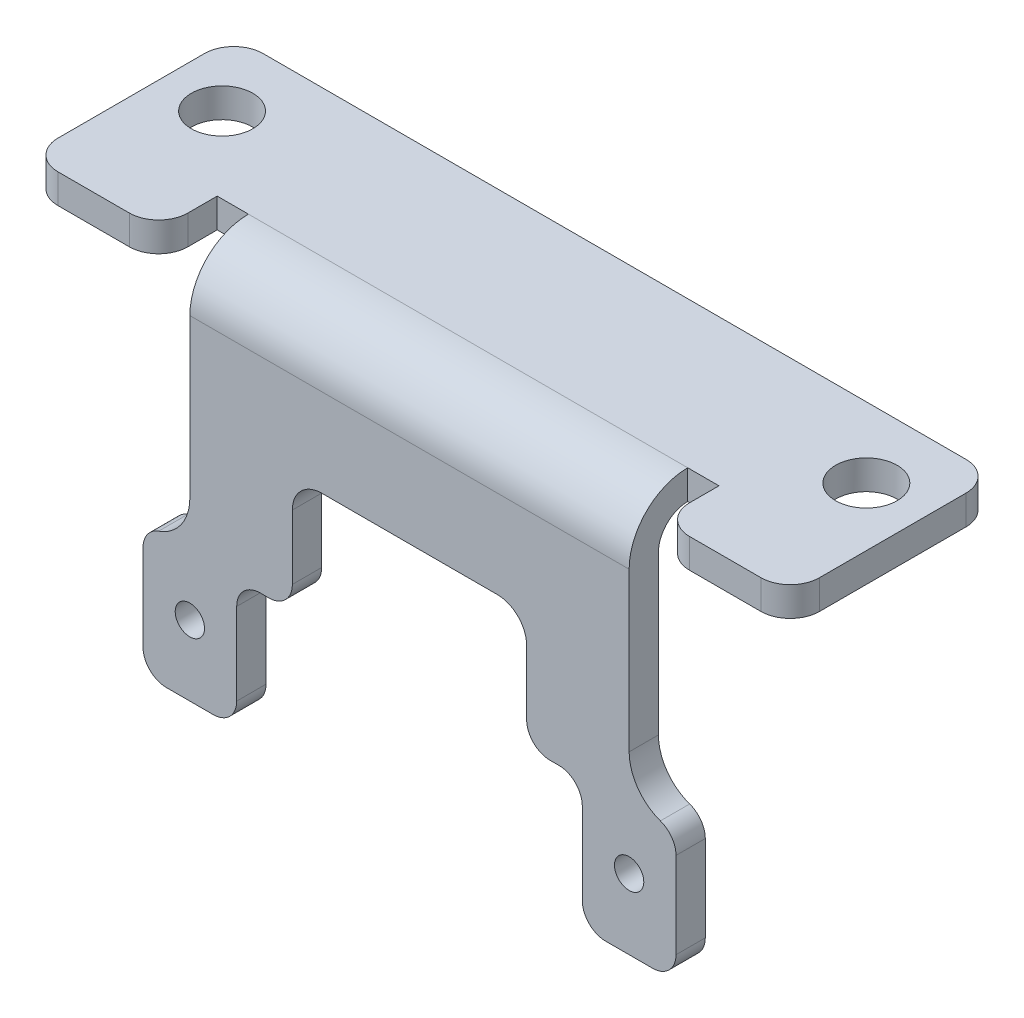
ISO-10303-21;
HEADER;
FILE_DESCRIPTION(('STEP AP214'),'2;1');
FILE_NAME('part.step','',(''),(''),'','','');
FILE_SCHEMA(('AUTOMOTIVE_DESIGN { 1 0 10303 214 1 1 1 1 }'));
ENDSEC;
DATA;
#1=APPLICATION_CONTEXT('core data for automotive mechanical design processes');
#2=APPLICATION_PROTOCOL_DEFINITION('international standard','automotive_design',2000,#1);
#3=PRODUCT_CONTEXT('',#1,'mechanical');
#4=PRODUCT('Part','Part','',(#3));
#5=PRODUCT_RELATED_PRODUCT_CATEGORY('part','',(#4));
#6=PRODUCT_DEFINITION_FORMATION('','',#4);
#7=PRODUCT_DEFINITION_CONTEXT('part definition',#1,'design');
#8=PRODUCT_DEFINITION('design','',#6,#7);
#9=PRODUCT_DEFINITION_SHAPE('','',#8);
#10=(LENGTH_UNIT() NAMED_UNIT(*) SI_UNIT(.MILLI.,.METRE.));
#11=(NAMED_UNIT(*) PLANE_ANGLE_UNIT() SI_UNIT($,.RADIAN.));
#12=(NAMED_UNIT(*) SI_UNIT($,.STERADIAN.) SOLID_ANGLE_UNIT());
#13=UNCERTAINTY_MEASURE_WITH_UNIT(LENGTH_MEASURE(1.E-05),#10,'distance_accuracy_value','');
#14=(GEOMETRIC_REPRESENTATION_CONTEXT(3) GLOBAL_UNCERTAINTY_ASSIGNED_CONTEXT((#13)) GLOBAL_UNIT_ASSIGNED_CONTEXT((#10,
#11,#12)) REPRESENTATION_CONTEXT('',''));
#15=CARTESIAN_POINT('',(0.,0.,0.));
#16=DIRECTION('',(0.,0.,1.));
#17=DIRECTION('',(1.,0.,0.));
#18=AXIS2_PLACEMENT_3D('',#15,#16,#17);
#19=CARTESIAN_POINT('',(47.5,35.,5.));
#20=DIRECTION('',(0.,0.,-1.));
#21=DIRECTION('',(-1.,0.,0.));
#22=AXIS2_PLACEMENT_3D('',#19,#20,#21);
#23=PLANE('',#22);
#24=CARTESIAN_POINT('',(-37.5,0.,5.));
#25=DIRECTION('',(0.,0.,1.));
#26=DIRECTION('',(-1.,0.,0.));
#27=AXIS2_PLACEMENT_3D('',#24,#25,#26);
#28=CIRCLE('',#27,2.50000000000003);
#29=CARTESIAN_POINT('',(-40.,0.,5.));
#30=VERTEX_POINT('',#29);
#31=EDGE_CURVE('E446',#30,#30,#28,.T.);
#32=ORIENTED_EDGE('',*,*,#31,.F.);
#33=EDGE_LOOP('',(#32));
#34=FACE_BOUND('',#33,.T.);
#35=CARTESIAN_POINT('',(37.5,0.,5.));
#36=DIRECTION('',(0.,0.,1.));
#37=DIRECTION('',(1.,0.,0.));
#38=AXIS2_PLACEMENT_3D('',#35,#36,#37);
#39=CIRCLE('',#38,2.5);
#40=CARTESIAN_POINT('',(40.,0.,5.));
#41=VERTEX_POINT('',#40);
#42=EDGE_CURVE('E453',#41,#41,#39,.T.);
#43=ORIENTED_EDGE('',*,*,#42,.F.);
#44=EDGE_LOOP('',(#43));
#45=FACE_BOUND('',#44,.T.);
#46=DIRECTION('',(1.,0.,0.));
#47=VECTOR('',#46,1.);
#48=CARTESIAN_POINT('',(47.5,45.,5.));
#49=LINE('',#48,#47);
#50=CARTESIAN_POINT('',(-37.5,45.,5.));
#51=VERTEX_POINT('',#50);
#52=CARTESIAN_POINT('',(37.5,45.,5.));
#53=VERTEX_POINT('',#52);
#54=EDGE_CURVE('E41',#51,#53,#49,.T.);
#55=ORIENTED_EDGE('',*,*,#54,.F.);
#56=DIRECTION('',(0.,-1.,0.));
#57=VECTOR('',#56,1.);
#58=CARTESIAN_POINT('',(-37.5,18.,5.));
#59=LINE('',#58,#57);
#60=CARTESIAN_POINT('',(-37.5,18.,5.));
#61=VERTEX_POINT('',#60);
#62=EDGE_CURVE('E459',#51,#61,#59,.T.);
#63=ORIENTED_EDGE('',*,*,#62,.T.);
#64=CARTESIAN_POINT('',(-45.5,18.,5.));
#65=DIRECTION('',(0.,0.,-1.));
#66=DIRECTION('',(-1.,0.,0.));
#67=AXIS2_PLACEMENT_3D('',#64,#65,#66);
#68=CIRCLE('',#67,8.);
#69=CARTESIAN_POINT('',(-42.8333333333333,10.4575276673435,5.));
#70=VERTEX_POINT('',#69);
#71=EDGE_CURVE('E461',#61,#70,#68,.T.);
#72=ORIENTED_EDGE('',*,*,#71,.T.);
#73=CARTESIAN_POINT('',(-41.5,6.68629150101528,5.));
#74=DIRECTION('',(0.,0.,1.));
#75=DIRECTION('',(-1.,0.,0.));
#76=AXIS2_PLACEMENT_3D('',#73,#74,#75);
#77=CIRCLE('',#76,4.);
#78=CARTESIAN_POINT('',(-45.5,6.68629150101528,5.));
#79=VERTEX_POINT('',#78);
#80=EDGE_CURVE('E464',#70,#79,#77,.T.);
#81=ORIENTED_EDGE('',*,*,#80,.T.);
#82=DIRECTION('',(0.,-1.,0.));
#83=VECTOR('',#82,1.);
#84=CARTESIAN_POINT('',(-45.5,-7.99999999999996,5.));
#85=LINE('',#84,#83);
#86=CARTESIAN_POINT('',(-45.5,-7.99999999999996,5.));
#87=VERTEX_POINT('',#86);
#88=EDGE_CURVE('E466',#79,#87,#85,.T.);
#89=ORIENTED_EDGE('',*,*,#88,.T.);
#90=CARTESIAN_POINT('',(-41.5,-7.99999999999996,5.));
#91=DIRECTION('',(0.,0.,1.));
#92=DIRECTION('',(-1.,0.,0.));
#93=AXIS2_PLACEMENT_3D('',#90,#91,#92);
#94=CIRCLE('',#93,3.99999999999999);
#95=CARTESIAN_POINT('',(-41.5,-11.9999999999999,5.));
#96=VERTEX_POINT('',#95);
#97=EDGE_CURVE('E468',#87,#96,#94,.T.);
#98=ORIENTED_EDGE('',*,*,#97,.T.);
#99=DIRECTION('',(1.,0.,0.));
#100=VECTOR('',#99,1.);
#101=CARTESIAN_POINT('',(-33.5,-11.9999999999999,5.));
#102=LINE('',#101,#100);
#103=CARTESIAN_POINT('',(-33.5,-11.9999999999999,5.));
#104=VERTEX_POINT('',#103);
#105=EDGE_CURVE('E470',#96,#104,#102,.T.);
#106=ORIENTED_EDGE('',*,*,#105,.T.);
#107=CARTESIAN_POINT('',(-33.5,-7.99999999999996,5.));
#108=DIRECTION('',(0.,0.,1.));
#109=DIRECTION('',(-1.,0.,0.));
#110=AXIS2_PLACEMENT_3D('',#107,#108,#109);
#111=CIRCLE('',#110,3.99999999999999);
#112=CARTESIAN_POINT('',(-29.5,-7.99999999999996,5.));
#113=VERTEX_POINT('',#112);
#114=EDGE_CURVE('E472',#104,#113,#111,.T.);
#115=ORIENTED_EDGE('',*,*,#114,.T.);
#116=DIRECTION('',(0.,1.,0.));
#117=VECTOR('',#116,1.);
#118=CARTESIAN_POINT('',(-29.5,6.00000000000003,5.));
#119=LINE('',#118,#117);
#120=CARTESIAN_POINT('',(-29.5,6.00000000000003,5.));
#121=VERTEX_POINT('',#120);
#122=EDGE_CURVE('E474',#113,#121,#119,.T.);
#123=ORIENTED_EDGE('',*,*,#122,.T.);
#124=CARTESIAN_POINT('',(-25.5,6.00000000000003,5.));
#125=DIRECTION('',(0.,0.,-1.));
#126=DIRECTION('',(-1.,0.,0.));
#127=AXIS2_PLACEMENT_3D('',#124,#125,#126);
#128=CIRCLE('',#127,4.);
#129=CARTESIAN_POINT('',(-25.5,10.,5.));
#130=VERTEX_POINT('',#129);
#131=EDGE_CURVE('E476',#121,#130,#128,.T.);
#132=ORIENTED_EDGE('',*,*,#131,.T.);
#133=DIRECTION('',(1.,0.,0.));
#134=VECTOR('',#133,1.);
#135=CARTESIAN_POINT('',(-24.,10.,5.));
#136=LINE('',#135,#134);
#137=CARTESIAN_POINT('',(-24.,10.,5.));
#138=VERTEX_POINT('',#137);
#139=EDGE_CURVE('E478',#130,#138,#136,.T.);
#140=ORIENTED_EDGE('',*,*,#139,.T.);
#141=CARTESIAN_POINT('',(-24.,14.,5.));
#142=DIRECTION('',(0.,0.,1.));
#143=DIRECTION('',(-1.,0.,0.));
#144=AXIS2_PLACEMENT_3D('',#141,#142,#143);
#145=CIRCLE('',#144,4.);
#146=CARTESIAN_POINT('',(-20.,14.,5.));
#147=VERTEX_POINT('',#146);
#148=EDGE_CURVE('E480',#138,#147,#145,.T.);
#149=ORIENTED_EDGE('',*,*,#148,.T.);
#150=DIRECTION('',(0.,1.,0.));
#151=VECTOR('',#150,1.);
#152=CARTESIAN_POINT('',(-20.,25.,5.));
#153=LINE('',#152,#151);
#154=CARTESIAN_POINT('',(-20.,25.,5.));
#155=VERTEX_POINT('',#154);
#156=EDGE_CURVE('E482',#147,#155,#153,.T.);
#157=ORIENTED_EDGE('',*,*,#156,.T.);
#158=CARTESIAN_POINT('',(-15.,25.,5.));
#159=DIRECTION('',(0.,0.,-1.));
#160=DIRECTION('',(1.,0.,0.));
#161=AXIS2_PLACEMENT_3D('',#158,#159,#160);
#162=CIRCLE('',#161,5.);
#163=CARTESIAN_POINT('',(-15.,30.,5.));
#164=VERTEX_POINT('',#163);
#165=EDGE_CURVE('E484',#155,#164,#162,.T.);
#166=ORIENTED_EDGE('',*,*,#165,.T.);
#167=DIRECTION('',(1.,0.,0.));
#168=VECTOR('',#167,1.);
#169=CARTESIAN_POINT('',(-15.,30.,5.));
#170=LINE('',#169,#168);
#171=CARTESIAN_POINT('',(15.,30.,5.));
#172=VERTEX_POINT('',#171);
#173=EDGE_CURVE('E486',#164,#172,#170,.T.);
#174=ORIENTED_EDGE('',*,*,#173,.T.);
#175=CARTESIAN_POINT('',(15.,25.,5.));
#176=DIRECTION('',(0.,0.,-1.));
#177=DIRECTION('',(-1.,0.,0.));
#178=AXIS2_PLACEMENT_3D('',#175,#176,#177);
#179=CIRCLE('',#178,5.);
#180=CARTESIAN_POINT('',(20.,25.,5.));
#181=VERTEX_POINT('',#180);
#182=EDGE_CURVE('E488',#172,#181,#179,.T.);
#183=ORIENTED_EDGE('',*,*,#182,.T.);
#184=DIRECTION('',(0.,-1.,0.));
#185=VECTOR('',#184,1.);
#186=CARTESIAN_POINT('',(20.,25.,5.));
#187=LINE('',#186,#185);
#188=CARTESIAN_POINT('',(20.,14.,5.));
#189=VERTEX_POINT('',#188);
#190=EDGE_CURVE('E490',#181,#189,#187,.T.);
#191=ORIENTED_EDGE('',*,*,#190,.T.);
#192=CARTESIAN_POINT('',(24.,14.,5.));
#193=DIRECTION('',(0.,0.,1.));
#194=DIRECTION('',(1.,0.,0.));
#195=AXIS2_PLACEMENT_3D('',#192,#193,#194);
#196=CIRCLE('',#195,4.);
#197=CARTESIAN_POINT('',(24.,10.,5.));
#198=VERTEX_POINT('',#197);
#199=EDGE_CURVE('E492',#189,#198,#196,.T.);
#200=ORIENTED_EDGE('',*,*,#199,.T.);
#201=DIRECTION('',(1.,0.,0.));
#202=VECTOR('',#201,1.);
#203=CARTESIAN_POINT('',(24.,10.,5.));
#204=LINE('',#203,#202);
#205=CARTESIAN_POINT('',(25.5,10.,5.));
#206=VERTEX_POINT('',#205);
#207=EDGE_CURVE('E494',#198,#206,#204,.T.);
#208=ORIENTED_EDGE('',*,*,#207,.T.);
#209=CARTESIAN_POINT('',(25.5,6.,5.));
#210=DIRECTION('',(0.,0.,-1.));
#211=DIRECTION('',(1.,0.,0.));
#212=AXIS2_PLACEMENT_3D('',#209,#210,#211);
#213=CIRCLE('',#212,4.);
#214=CARTESIAN_POINT('',(29.5,6.,5.));
#215=VERTEX_POINT('',#214);
#216=EDGE_CURVE('E496',#206,#215,#213,.T.);
#217=ORIENTED_EDGE('',*,*,#216,.T.);
#218=DIRECTION('',(0.,-1.,0.));
#219=VECTOR('',#218,1.);
#220=CARTESIAN_POINT('',(29.5,6.,5.));
#221=LINE('',#220,#219);
#222=CARTESIAN_POINT('',(29.5,-7.99999999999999,5.));
#223=VERTEX_POINT('',#222);
#224=EDGE_CURVE('E498',#215,#223,#221,.T.);
#225=ORIENTED_EDGE('',*,*,#224,.T.);
#226=CARTESIAN_POINT('',(33.5,-7.99999999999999,5.));
#227=DIRECTION('',(0.,0.,1.));
#228=DIRECTION('',(1.,0.,0.));
#229=AXIS2_PLACEMENT_3D('',#226,#227,#228);
#230=CIRCLE('',#229,4.);
#231=CARTESIAN_POINT('',(33.5,-12.,5.));
#232=VERTEX_POINT('',#231);
#233=EDGE_CURVE('E500',#223,#232,#230,.T.);
#234=ORIENTED_EDGE('',*,*,#233,.T.);
#235=DIRECTION('',(1.,0.,0.));
#236=VECTOR('',#235,1.);
#237=CARTESIAN_POINT('',(33.5,-12.,5.));
#238=LINE('',#237,#236);
#239=CARTESIAN_POINT('',(41.5,-12.,5.));
#240=VERTEX_POINT('',#239);
#241=EDGE_CURVE('E502',#232,#240,#238,.T.);
#242=ORIENTED_EDGE('',*,*,#241,.T.);
#243=CARTESIAN_POINT('',(41.5,-7.99999999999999,5.));
#244=DIRECTION('',(0.,0.,1.));
#245=DIRECTION('',(1.,0.,0.));
#246=AXIS2_PLACEMENT_3D('',#243,#244,#245);
#247=CIRCLE('',#246,4.);
#248=CARTESIAN_POINT('',(45.5,-7.99999999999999,5.));
#249=VERTEX_POINT('',#248);
#250=EDGE_CURVE('E504',#240,#249,#247,.T.);
#251=ORIENTED_EDGE('',*,*,#250,.T.);
#252=DIRECTION('',(0.,1.,0.));
#253=VECTOR('',#252,1.);
#254=CARTESIAN_POINT('',(45.5,-7.99999999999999,5.));
#255=LINE('',#254,#253);
#256=CARTESIAN_POINT('',(45.5,6.68629150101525,5.));
#257=VERTEX_POINT('',#256);
#258=EDGE_CURVE('E506',#249,#257,#255,.T.);
#259=ORIENTED_EDGE('',*,*,#258,.T.);
#260=CARTESIAN_POINT('',(41.5,6.68629150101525,5.));
#261=DIRECTION('',(0.,0.,1.));
#262=DIRECTION('',(1.,0.,0.));
#263=AXIS2_PLACEMENT_3D('',#260,#261,#262);
#264=CIRCLE('',#263,4.);
#265=CARTESIAN_POINT('',(42.8333333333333,10.4575276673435,5.));
#266=VERTEX_POINT('',#265);
#267=EDGE_CURVE('E508',#257,#266,#264,.T.);
#268=ORIENTED_EDGE('',*,*,#267,.T.);
#269=CARTESIAN_POINT('',(45.5,18.,5.));
#270=DIRECTION('',(0.,0.,-1.));
#271=DIRECTION('',(1.,0.,0.));
#272=AXIS2_PLACEMENT_3D('',#269,#270,#271);
#273=CIRCLE('',#272,8.);
#274=CARTESIAN_POINT('',(37.5,18.,5.));
#275=VERTEX_POINT('',#274);
#276=EDGE_CURVE('E510',#266,#275,#273,.T.);
#277=ORIENTED_EDGE('',*,*,#276,.T.);
#278=DIRECTION('',(0.,1.,0.));
#279=VECTOR('',#278,1.);
#280=CARTESIAN_POINT('',(37.5,18.,5.));
#281=LINE('',#280,#279);
#282=EDGE_CURVE('E512',#275,#53,#281,.T.);
#283=ORIENTED_EDGE('',*,*,#282,.T.);
#284=EDGE_LOOP('',(#55,#63,#72,#81,#89,#98,#106,#115,#123,#132,#140,#149,#157,#166,#174,#183,
#191,#200,#208,#217,#225,#234,#242,#251,#259,#268,#277,#283));
#285=FACE_BOUND('',#284,.T.);
#286=ADVANCED_FACE('F37',(#34,#45,#285),#23,.F.);
#287=CARTESIAN_POINT('',(47.5,35.,0.));
#288=DIRECTION('',(0.,0.,-1.));
#289=DIRECTION('',(-1.,0.,0.));
#290=AXIS2_PLACEMENT_3D('',#287,#288,#289);
#291=PLANE('',#290);
#292=DIRECTION('',(0.,-1.,0.));
#293=VECTOR('',#292,1.);
#294=CARTESIAN_POINT('',(-37.5,18.,0.));
#295=LINE('',#294,#293);
#296=CARTESIAN_POINT('',(-37.5,45.,0.));
#297=VERTEX_POINT('',#296);
#298=CARTESIAN_POINT('',(-37.5,18.,0.));
#299=VERTEX_POINT('',#298);
#300=EDGE_CURVE('E456',#297,#299,#295,.T.);
#301=ORIENTED_EDGE('',*,*,#300,.F.);
#302=DIRECTION('',(-1.,0.,0.));
#303=VECTOR('',#302,1.);
#304=CARTESIAN_POINT('',(65.,45.,0.));
#305=LINE('',#304,#303);
#306=CARTESIAN_POINT('',(37.5,45.,0.));
#307=VERTEX_POINT('',#306);
#308=EDGE_CURVE('E439',#307,#297,#305,.T.);
#309=ORIENTED_EDGE('',*,*,#308,.F.);
#310=DIRECTION('',(0.,1.,0.));
#311=VECTOR('',#310,1.);
#312=CARTESIAN_POINT('',(37.5,18.,0.));
#313=LINE('',#312,#311);
#314=CARTESIAN_POINT('',(37.5,18.,0.));
#315=VERTEX_POINT('',#314);
#316=EDGE_CURVE('E462',#315,#307,#313,.T.);
#317=ORIENTED_EDGE('',*,*,#316,.F.);
#318=CARTESIAN_POINT('',(45.5,18.,0.));
#319=DIRECTION('',(0.,0.,-1.));
#320=DIRECTION('',(1.,0.,0.));
#321=AXIS2_PLACEMENT_3D('',#318,#319,#320);
#322=CIRCLE('',#321,8.);
#323=CARTESIAN_POINT('',(42.8333333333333,10.4575276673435,0.));
#324=VERTEX_POINT('',#323);
#325=EDGE_CURVE('E565',#324,#315,#322,.T.);
#326=ORIENTED_EDGE('',*,*,#325,.F.);
#327=CARTESIAN_POINT('',(41.5,6.68629150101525,0.));
#328=DIRECTION('',(0.,0.,1.));
#329=DIRECTION('',(1.,0.,0.));
#330=AXIS2_PLACEMENT_3D('',#327,#328,#329);
#331=CIRCLE('',#330,4.);
#332=CARTESIAN_POINT('',(45.5,6.68629150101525,0.));
#333=VERTEX_POINT('',#332);
#334=EDGE_CURVE('E563',#333,#324,#331,.T.);
#335=ORIENTED_EDGE('',*,*,#334,.F.);
#336=DIRECTION('',(0.,1.,0.));
#337=VECTOR('',#336,1.);
#338=CARTESIAN_POINT('',(45.5,-7.99999999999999,0.));
#339=LINE('',#338,#337);
#340=CARTESIAN_POINT('',(45.5,-7.99999999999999,0.));
#341=VERTEX_POINT('',#340);
#342=EDGE_CURVE('E561',#341,#333,#339,.T.);
#343=ORIENTED_EDGE('',*,*,#342,.F.);
#344=CARTESIAN_POINT('',(41.5,-7.99999999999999,0.));
#345=DIRECTION('',(0.,0.,1.));
#346=DIRECTION('',(1.,0.,0.));
#347=AXIS2_PLACEMENT_3D('',#344,#345,#346);
#348=CIRCLE('',#347,4.);
#349=CARTESIAN_POINT('',(41.5,-12.,0.));
#350=VERTEX_POINT('',#349);
#351=EDGE_CURVE('E559',#350,#341,#348,.T.);
#352=ORIENTED_EDGE('',*,*,#351,.F.);
#353=DIRECTION('',(1.,0.,0.));
#354=VECTOR('',#353,1.);
#355=CARTESIAN_POINT('',(33.5,-12.,0.));
#356=LINE('',#355,#354);
#357=CARTESIAN_POINT('',(33.5,-12.,0.));
#358=VERTEX_POINT('',#357);
#359=EDGE_CURVE('E557',#358,#350,#356,.T.);
#360=ORIENTED_EDGE('',*,*,#359,.F.);
#361=CARTESIAN_POINT('',(33.5,-7.99999999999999,0.));
#362=DIRECTION('',(0.,0.,1.));
#363=DIRECTION('',(1.,0.,0.));
#364=AXIS2_PLACEMENT_3D('',#361,#362,#363);
#365=CIRCLE('',#364,4.);
#366=CARTESIAN_POINT('',(29.5,-7.99999999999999,0.));
#367=VERTEX_POINT('',#366);
#368=EDGE_CURVE('E555',#367,#358,#365,.T.);
#369=ORIENTED_EDGE('',*,*,#368,.F.);
#370=DIRECTION('',(0.,-1.,0.));
#371=VECTOR('',#370,1.);
#372=CARTESIAN_POINT('',(29.5,6.,0.));
#373=LINE('',#372,#371);
#374=CARTESIAN_POINT('',(29.5,6.,0.));
#375=VERTEX_POINT('',#374);
#376=EDGE_CURVE('E553',#375,#367,#373,.T.);
#377=ORIENTED_EDGE('',*,*,#376,.F.);
#378=CARTESIAN_POINT('',(25.5,6.,0.));
#379=DIRECTION('',(0.,0.,-1.));
#380=DIRECTION('',(1.,0.,0.));
#381=AXIS2_PLACEMENT_3D('',#378,#379,#380);
#382=CIRCLE('',#381,4.);
#383=CARTESIAN_POINT('',(25.5,10.,0.));
#384=VERTEX_POINT('',#383);
#385=EDGE_CURVE('E551',#384,#375,#382,.T.);
#386=ORIENTED_EDGE('',*,*,#385,.F.);
#387=DIRECTION('',(1.,0.,0.));
#388=VECTOR('',#387,1.);
#389=CARTESIAN_POINT('',(24.,10.,0.));
#390=LINE('',#389,#388);
#391=CARTESIAN_POINT('',(24.,10.,0.));
#392=VERTEX_POINT('',#391);
#393=EDGE_CURVE('E549',#392,#384,#390,.T.);
#394=ORIENTED_EDGE('',*,*,#393,.F.);
#395=CARTESIAN_POINT('',(24.,14.,0.));
#396=DIRECTION('',(0.,0.,1.));
#397=DIRECTION('',(1.,0.,0.));
#398=AXIS2_PLACEMENT_3D('',#395,#396,#397);
#399=CIRCLE('',#398,4.);
#400=CARTESIAN_POINT('',(20.,14.,0.));
#401=VERTEX_POINT('',#400);
#402=EDGE_CURVE('E547',#401,#392,#399,.T.);
#403=ORIENTED_EDGE('',*,*,#402,.F.);
#404=DIRECTION('',(0.,-1.,0.));
#405=VECTOR('',#404,1.);
#406=CARTESIAN_POINT('',(20.,25.,0.));
#407=LINE('',#406,#405);
#408=CARTESIAN_POINT('',(20.,25.,0.));
#409=VERTEX_POINT('',#408);
#410=EDGE_CURVE('E545',#409,#401,#407,.T.);
#411=ORIENTED_EDGE('',*,*,#410,.F.);
#412=CARTESIAN_POINT('',(15.,25.,0.));
#413=DIRECTION('',(0.,0.,-1.));
#414=DIRECTION('',(-1.,0.,0.));
#415=AXIS2_PLACEMENT_3D('',#412,#413,#414);
#416=CIRCLE('',#415,5.);
#417=CARTESIAN_POINT('',(15.,30.,0.));
#418=VERTEX_POINT('',#417);
#419=EDGE_CURVE('E543',#418,#409,#416,.T.);
#420=ORIENTED_EDGE('',*,*,#419,.F.);
#421=DIRECTION('',(1.,0.,0.));
#422=VECTOR('',#421,1.);
#423=CARTESIAN_POINT('',(-15.,30.,0.));
#424=LINE('',#423,#422);
#425=CARTESIAN_POINT('',(-15.,30.,0.));
#426=VERTEX_POINT('',#425);
#427=EDGE_CURVE('E541',#426,#418,#424,.T.);
#428=ORIENTED_EDGE('',*,*,#427,.F.);
#429=CARTESIAN_POINT('',(-15.,25.,0.));
#430=DIRECTION('',(0.,0.,-1.));
#431=DIRECTION('',(1.,0.,0.));
#432=AXIS2_PLACEMENT_3D('',#429,#430,#431);
#433=CIRCLE('',#432,5.);
#434=CARTESIAN_POINT('',(-20.,25.,0.));
#435=VERTEX_POINT('',#434);
#436=EDGE_CURVE('E539',#435,#426,#433,.T.);
#437=ORIENTED_EDGE('',*,*,#436,.F.);
#438=DIRECTION('',(0.,1.,0.));
#439=VECTOR('',#438,1.);
#440=CARTESIAN_POINT('',(-20.,25.,0.));
#441=LINE('',#440,#439);
#442=CARTESIAN_POINT('',(-20.,14.,0.));
#443=VERTEX_POINT('',#442);
#444=EDGE_CURVE('E537',#443,#435,#441,.T.);
#445=ORIENTED_EDGE('',*,*,#444,.F.);
#446=CARTESIAN_POINT('',(-24.,14.,0.));
#447=DIRECTION('',(0.,0.,1.));
#448=DIRECTION('',(-1.,0.,0.));
#449=AXIS2_PLACEMENT_3D('',#446,#447,#448);
#450=CIRCLE('',#449,4.);
#451=CARTESIAN_POINT('',(-24.,10.,0.));
#452=VERTEX_POINT('',#451);
#453=EDGE_CURVE('E535',#452,#443,#450,.T.);
#454=ORIENTED_EDGE('',*,*,#453,.F.);
#455=DIRECTION('',(1.,0.,0.));
#456=VECTOR('',#455,1.);
#457=CARTESIAN_POINT('',(-24.,10.,0.));
#458=LINE('',#457,#456);
#459=CARTESIAN_POINT('',(-25.5,10.,0.));
#460=VERTEX_POINT('',#459);
#461=EDGE_CURVE('E533',#460,#452,#458,.T.);
#462=ORIENTED_EDGE('',*,*,#461,.F.);
#463=CARTESIAN_POINT('',(-25.5,6.00000000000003,0.));
#464=DIRECTION('',(0.,0.,-1.));
#465=DIRECTION('',(-1.,0.,0.));
#466=AXIS2_PLACEMENT_3D('',#463,#464,#465);
#467=CIRCLE('',#466,4.);
#468=CARTESIAN_POINT('',(-29.5,6.00000000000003,0.));
#469=VERTEX_POINT('',#468);
#470=EDGE_CURVE('E531',#469,#460,#467,.T.);
#471=ORIENTED_EDGE('',*,*,#470,.F.);
#472=DIRECTION('',(0.,1.,0.));
#473=VECTOR('',#472,1.);
#474=CARTESIAN_POINT('',(-29.5,6.00000000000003,0.));
#475=LINE('',#474,#473);
#476=CARTESIAN_POINT('',(-29.5,-7.99999999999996,0.));
#477=VERTEX_POINT('',#476);
#478=EDGE_CURVE('E529',#477,#469,#475,.T.);
#479=ORIENTED_EDGE('',*,*,#478,.F.);
#480=CARTESIAN_POINT('',(-33.5,-7.99999999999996,0.));
#481=DIRECTION('',(0.,0.,1.));
#482=DIRECTION('',(-1.,0.,0.));
#483=AXIS2_PLACEMENT_3D('',#480,#481,#482);
#484=CIRCLE('',#483,3.99999999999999);
#485=CARTESIAN_POINT('',(-33.5,-11.9999999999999,0.));
#486=VERTEX_POINT('',#485);
#487=EDGE_CURVE('E527',#486,#477,#484,.T.);
#488=ORIENTED_EDGE('',*,*,#487,.F.);
#489=DIRECTION('',(1.,0.,0.));
#490=VECTOR('',#489,1.);
#491=CARTESIAN_POINT('',(-33.5,-11.9999999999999,0.));
#492=LINE('',#491,#490);
#493=CARTESIAN_POINT('',(-41.5,-11.9999999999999,0.));
#494=VERTEX_POINT('',#493);
#495=EDGE_CURVE('E525',#494,#486,#492,.T.);
#496=ORIENTED_EDGE('',*,*,#495,.F.);
#497=CARTESIAN_POINT('',(-41.5,-7.99999999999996,0.));
#498=DIRECTION('',(0.,0.,1.));
#499=DIRECTION('',(-1.,0.,0.));
#500=AXIS2_PLACEMENT_3D('',#497,#498,#499);
#501=CIRCLE('',#500,3.99999999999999);
#502=CARTESIAN_POINT('',(-45.5,-7.99999999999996,0.));
#503=VERTEX_POINT('',#502);
#504=EDGE_CURVE('E523',#503,#494,#501,.T.);
#505=ORIENTED_EDGE('',*,*,#504,.F.);
#506=DIRECTION('',(0.,-1.,0.));
#507=VECTOR('',#506,1.);
#508=CARTESIAN_POINT('',(-45.5,-7.99999999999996,0.));
#509=LINE('',#508,#507);
#510=CARTESIAN_POINT('',(-45.5,6.68629150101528,0.));
#511=VERTEX_POINT('',#510);
#512=EDGE_CURVE('E521',#511,#503,#509,.T.);
#513=ORIENTED_EDGE('',*,*,#512,.F.);
#514=CARTESIAN_POINT('',(-41.5,6.68629150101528,0.));
#515=DIRECTION('',(0.,0.,1.));
#516=DIRECTION('',(-1.,0.,0.));
#517=AXIS2_PLACEMENT_3D('',#514,#515,#516);
#518=CIRCLE('',#517,4.);
#519=CARTESIAN_POINT('',(-42.8333333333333,10.4575276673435,0.));
#520=VERTEX_POINT('',#519);
#521=EDGE_CURVE('E519',#520,#511,#518,.T.);
#522=ORIENTED_EDGE('',*,*,#521,.F.);
#523=CARTESIAN_POINT('',(-45.5,18.,0.));
#524=DIRECTION('',(0.,0.,-1.));
#525=DIRECTION('',(-1.,0.,0.));
#526=AXIS2_PLACEMENT_3D('',#523,#524,#525);
#527=CIRCLE('',#526,8.);
#528=EDGE_CURVE('E517',#299,#520,#527,.T.);
#529=ORIENTED_EDGE('',*,*,#528,.F.);
#530=EDGE_LOOP('',(#301,#309,#317,#326,#335,#343,#352,#360,#369,#377,#386,#394,#403,#411,#420,
#428,#437,#445,#454,#462,#471,#479,#488,#496,#505,#513,#522,#529));
#531=FACE_BOUND('',#530,.T.);
#532=CARTESIAN_POINT('',(-37.5,0.,0.));
#533=DIRECTION('',(0.,0.,1.));
#534=DIRECTION('',(-1.,0.,0.));
#535=AXIS2_PLACEMENT_3D('',#532,#533,#534);
#536=CIRCLE('',#535,2.50000000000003);
#537=CARTESIAN_POINT('',(-40.,0.,0.));
#538=VERTEX_POINT('',#537);
#539=EDGE_CURVE('E450',#538,#538,#536,.T.);
#540=ORIENTED_EDGE('',*,*,#539,.T.);
#541=EDGE_LOOP('',(#540));
#542=FACE_BOUND('',#541,.T.);
#543=CARTESIAN_POINT('',(37.5,0.,0.));
#544=DIRECTION('',(0.,0.,1.));
#545=DIRECTION('',(1.,0.,0.));
#546=AXIS2_PLACEMENT_3D('',#543,#544,#545);
#547=CIRCLE('',#546,2.5);
#548=CARTESIAN_POINT('',(40.,0.,0.));
#549=VERTEX_POINT('',#548);
#550=EDGE_CURVE('E449',#549,#549,#547,.T.);
#551=ORIENTED_EDGE('',*,*,#550,.T.);
#552=EDGE_LOOP('',(#551));
#553=FACE_BOUND('',#552,.T.);
#554=ADVANCED_FACE('F682',(#531,#542,#553),#291,.T.);
#555=CARTESIAN_POINT('',(-37.5,18.,5.));
#556=DIRECTION('',(1.,0.,0.));
#557=DIRECTION('',(0.,0.,-1.));
#558=AXIS2_PLACEMENT_3D('',#555,#556,#557);
#559=PLANE('',#558);
#560=ORIENTED_EDGE('',*,*,#300,.T.);
#561=DIRECTION('',(0.,0.,-1.));
#562=VECTOR('',#561,1.);
#563=CARTESIAN_POINT('',(-37.5,18.,5.));
#564=LINE('',#563,#562);
#565=EDGE_CURVE('E642',#61,#299,#564,.T.);
#566=ORIENTED_EDGE('',*,*,#565,.F.);
#567=ORIENTED_EDGE('',*,*,#62,.F.);
#568=CARTESIAN_POINT('',(-37.5,45.,-5.));
#569=DIRECTION('',(1.,0.,0.));
#570=DIRECTION('',(0.,0.,-1.));
#571=AXIS2_PLACEMENT_3D('',#568,#569,#570);
#572=CIRCLE('',#571,9.99999999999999);
#573=CARTESIAN_POINT('',(-37.5,55.,-5.));
#574=VERTEX_POINT('',#573);
#575=EDGE_CURVE('E407',#51,#574,#572,.F.);
#576=ORIENTED_EDGE('',*,*,#575,.T.);
#577=DIRECTION('',(0.,1.,0.));
#578=VECTOR('',#577,1.);
#579=CARTESIAN_POINT('',(-37.5,34.9999999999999,-5.));
#580=LINE('',#579,#578);
#581=CARTESIAN_POINT('',(-37.5,50.,-5.));
#582=VERTEX_POINT('',#581);
#583=EDGE_CURVE('E394',#582,#574,#580,.T.);
#584=ORIENTED_EDGE('',*,*,#583,.F.);
#585=CARTESIAN_POINT('',(-37.5,45.,-5.));
#586=DIRECTION('',(1.,0.,0.));
#587=DIRECTION('',(0.,0.,-1.));
#588=AXIS2_PLACEMENT_3D('',#585,#586,#587);
#589=CIRCLE('',#588,4.99999999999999);
#590=EDGE_CURVE('E11',#297,#582,#589,.F.);
#591=ORIENTED_EDGE('',*,*,#590,.F.);
#592=EDGE_LOOP('',(#560,#566,#567,#576,#584,#591));
#593=FACE_BOUND('',#592,.T.);
#594=ADVANCED_FACE('F690',(#593),#559,.F.);
#595=CARTESIAN_POINT('',(-45.5,18.,5.));
#596=DIRECTION('',(0.,0.,-1.));
#597=DIRECTION('',(-1.,0.,0.));
#598=AXIS2_PLACEMENT_3D('',#595,#596,#597);
#599=CYLINDRICAL_SURFACE('',#598,8.);
#600=ORIENTED_EDGE('',*,*,#528,.T.);
#601=DIRECTION('',(0.,0.,-1.));
#602=VECTOR('',#601,1.);
#603=CARTESIAN_POINT('',(-42.8333333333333,10.4575276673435,5.));
#604=LINE('',#603,#602);
#605=EDGE_CURVE('E639',#70,#520,#604,.T.);
#606=ORIENTED_EDGE('',*,*,#605,.F.);
#607=ORIENTED_EDGE('',*,*,#71,.F.);
#608=ORIENTED_EDGE('',*,*,#565,.T.);
#609=EDGE_LOOP('',(#600,#606,#607,#608));
#610=FACE_BOUND('',#609,.T.);
#611=ADVANCED_FACE('F822',(#610),#599,.F.);
#612=CARTESIAN_POINT('',(-41.5,6.68629150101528,5.));
#613=DIRECTION('',(0.,0.,-1.));
#614=DIRECTION('',(-1.,0.,0.));
#615=AXIS2_PLACEMENT_3D('',#612,#613,#614);
#616=CYLINDRICAL_SURFACE('',#615,4.);
#617=ORIENTED_EDGE('',*,*,#521,.T.);
#618=DIRECTION('',(0.,0.,-1.));
#619=VECTOR('',#618,1.);
#620=CARTESIAN_POINT('',(-45.5,6.68629150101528,5.));
#621=LINE('',#620,#619);
#622=EDGE_CURVE('E636',#79,#511,#621,.T.);
#623=ORIENTED_EDGE('',*,*,#622,.F.);
#624=ORIENTED_EDGE('',*,*,#80,.F.);
#625=ORIENTED_EDGE('',*,*,#605,.T.);
#626=EDGE_LOOP('',(#617,#623,#624,#625));
#627=FACE_BOUND('',#626,.T.);
#628=ADVANCED_FACE('F817',(#627),#616,.T.);
#629=CARTESIAN_POINT('',(-45.5,-7.99999999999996,5.));
#630=DIRECTION('',(1.,0.,0.));
#631=DIRECTION('',(0.,0.,-1.));
#632=AXIS2_PLACEMENT_3D('',#629,#630,#631);
#633=PLANE('',#632);
#634=ORIENTED_EDGE('',*,*,#512,.T.);
#635=DIRECTION('',(0.,0.,-1.));
#636=VECTOR('',#635,1.);
#637=CARTESIAN_POINT('',(-45.5,-7.99999999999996,5.));
#638=LINE('',#637,#636);
#639=EDGE_CURVE('E633',#87,#503,#638,.T.);
#640=ORIENTED_EDGE('',*,*,#639,.F.);
#641=ORIENTED_EDGE('',*,*,#88,.F.);
#642=ORIENTED_EDGE('',*,*,#622,.T.);
#643=EDGE_LOOP('',(#634,#640,#641,#642));
#644=FACE_BOUND('',#643,.T.);
#645=ADVANCED_FACE('F814',(#644),#633,.F.);
#646=CARTESIAN_POINT('',(-41.5,-7.99999999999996,5.));
#647=DIRECTION('',(0.,0.,-1.));
#648=DIRECTION('',(-1.,0.,0.));
#649=AXIS2_PLACEMENT_3D('',#646,#647,#648);
#650=CYLINDRICAL_SURFACE('',#649,3.99999999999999);
#651=ORIENTED_EDGE('',*,*,#504,.T.);
#652=DIRECTION('',(0.,0.,-1.));
#653=VECTOR('',#652,1.);
#654=CARTESIAN_POINT('',(-41.5,-11.9999999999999,5.));
#655=LINE('',#654,#653);
#656=EDGE_CURVE('E630',#96,#494,#655,.T.);
#657=ORIENTED_EDGE('',*,*,#656,.F.);
#658=ORIENTED_EDGE('',*,*,#97,.F.);
#659=ORIENTED_EDGE('',*,*,#639,.T.);
#660=EDGE_LOOP('',(#651,#657,#658,#659));
#661=FACE_BOUND('',#660,.T.);
#662=ADVANCED_FACE('F810',(#661),#650,.T.);
#663=CARTESIAN_POINT('',(-33.5,-11.9999999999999,5.));
#664=DIRECTION('',(0.,1.,0.));
#665=DIRECTION('',(0.,0.,1.));
#666=AXIS2_PLACEMENT_3D('',#663,#664,#665);
#667=PLANE('',#666);
#668=ORIENTED_EDGE('',*,*,#495,.T.);
#669=DIRECTION('',(0.,0.,-1.));
#670=VECTOR('',#669,1.);
#671=CARTESIAN_POINT('',(-33.5,-11.9999999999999,5.));
#672=LINE('',#671,#670);
#673=EDGE_CURVE('E627',#104,#486,#672,.T.);
#674=ORIENTED_EDGE('',*,*,#673,.F.);
#675=ORIENTED_EDGE('',*,*,#105,.F.);
#676=ORIENTED_EDGE('',*,*,#656,.T.);
#677=EDGE_LOOP('',(#668,#674,#675,#676));
#678=FACE_BOUND('',#677,.T.);
#679=ADVANCED_FACE('F805',(#678),#667,.F.);
#680=CARTESIAN_POINT('',(-33.5,-7.99999999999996,5.));
#681=DIRECTION('',(0.,0.,-1.));
#682=DIRECTION('',(-1.,0.,0.));
#683=AXIS2_PLACEMENT_3D('',#680,#681,#682);
#684=CYLINDRICAL_SURFACE('',#683,3.99999999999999);
#685=ORIENTED_EDGE('',*,*,#487,.T.);
#686=DIRECTION('',(0.,0.,-1.));
#687=VECTOR('',#686,1.);
#688=CARTESIAN_POINT('',(-29.5,-7.99999999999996,5.));
#689=LINE('',#688,#687);
#690=EDGE_CURVE('E624',#113,#477,#689,.T.);
#691=ORIENTED_EDGE('',*,*,#690,.F.);
#692=ORIENTED_EDGE('',*,*,#114,.F.);
#693=ORIENTED_EDGE('',*,*,#673,.T.);
#694=EDGE_LOOP('',(#685,#691,#692,#693));
#695=FACE_BOUND('',#694,.T.);
#696=ADVANCED_FACE('F799',(#695),#684,.T.);
#697=CARTESIAN_POINT('',(-29.5,6.00000000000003,5.));
#698=DIRECTION('',(-1.,0.,0.));
#699=DIRECTION('',(0.,-1.,0.));
#700=AXIS2_PLACEMENT_3D('',#697,#698,#699);
#701=PLANE('',#700);
#702=ORIENTED_EDGE('',*,*,#478,.T.);
#703=DIRECTION('',(0.,0.,-1.));
#704=VECTOR('',#703,1.);
#705=CARTESIAN_POINT('',(-29.5,6.00000000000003,5.));
#706=LINE('',#705,#704);
#707=EDGE_CURVE('E621',#121,#469,#706,.T.);
#708=ORIENTED_EDGE('',*,*,#707,.F.);
#709=ORIENTED_EDGE('',*,*,#122,.F.);
#710=ORIENTED_EDGE('',*,*,#690,.T.);
#711=EDGE_LOOP('',(#702,#708,#709,#710));
#712=FACE_BOUND('',#711,.T.);
#713=ADVANCED_FACE('F795',(#712),#701,.F.);
#714=CARTESIAN_POINT('',(-25.5,6.00000000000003,5.));
#715=DIRECTION('',(0.,0.,-1.));
#716=DIRECTION('',(-1.,0.,0.));
#717=AXIS2_PLACEMENT_3D('',#714,#715,#716);
#718=CYLINDRICAL_SURFACE('',#717,4.);
#719=ORIENTED_EDGE('',*,*,#470,.T.);
#720=DIRECTION('',(0.,0.,-1.));
#721=VECTOR('',#720,1.);
#722=CARTESIAN_POINT('',(-25.5,10.,5.));
#723=LINE('',#722,#721);
#724=EDGE_CURVE('E618',#130,#460,#723,.T.);
#725=ORIENTED_EDGE('',*,*,#724,.F.);
#726=ORIENTED_EDGE('',*,*,#131,.F.);
#727=ORIENTED_EDGE('',*,*,#707,.T.);
#728=EDGE_LOOP('',(#719,#725,#726,#727));
#729=FACE_BOUND('',#728,.T.);
#730=ADVANCED_FACE('F790',(#729),#718,.F.);
#731=CARTESIAN_POINT('',(-24.,10.,5.));
#732=DIRECTION('',(0.,1.,0.));
#733=DIRECTION('',(-1.,0.,0.));
#734=AXIS2_PLACEMENT_3D('',#731,#732,#733);
#735=PLANE('',#734);
#736=ORIENTED_EDGE('',*,*,#461,.T.);
#737=DIRECTION('',(0.,0.,-1.));
#738=VECTOR('',#737,1.);
#739=CARTESIAN_POINT('',(-24.,10.,5.));
#740=LINE('',#739,#738);
#741=EDGE_CURVE('E615',#138,#452,#740,.T.);
#742=ORIENTED_EDGE('',*,*,#741,.F.);
#743=ORIENTED_EDGE('',*,*,#139,.F.);
#744=ORIENTED_EDGE('',*,*,#724,.T.);
#745=EDGE_LOOP('',(#736,#742,#743,#744));
#746=FACE_BOUND('',#745,.T.);
#747=ADVANCED_FACE('F784',(#746),#735,.F.);
#748=CARTESIAN_POINT('',(-24.,14.,5.));
#749=DIRECTION('',(0.,0.,-1.));
#750=DIRECTION('',(-1.,0.,0.));
#751=AXIS2_PLACEMENT_3D('',#748,#749,#750);
#752=CYLINDRICAL_SURFACE('',#751,4.);
#753=ORIENTED_EDGE('',*,*,#453,.T.);
#754=DIRECTION('',(0.,0.,-1.));
#755=VECTOR('',#754,1.);
#756=CARTESIAN_POINT('',(-20.,14.,5.));
#757=LINE('',#756,#755);
#758=EDGE_CURVE('E612',#147,#443,#757,.T.);
#759=ORIENTED_EDGE('',*,*,#758,.F.);
#760=ORIENTED_EDGE('',*,*,#148,.F.);
#761=ORIENTED_EDGE('',*,*,#741,.T.);
#762=EDGE_LOOP('',(#753,#759,#760,#761));
#763=FACE_BOUND('',#762,.T.);
#764=ADVANCED_FACE('F780',(#763),#752,.T.);
#765=CARTESIAN_POINT('',(-20.,25.,5.));
#766=DIRECTION('',(-1.,0.,0.));
#767=DIRECTION('',(0.,-1.,0.));
#768=AXIS2_PLACEMENT_3D('',#765,#766,#767);
#769=PLANE('',#768);
#770=ORIENTED_EDGE('',*,*,#444,.T.);
#771=DIRECTION('',(0.,0.,-1.));
#772=VECTOR('',#771,1.);
#773=CARTESIAN_POINT('',(-20.,25.,5.));
#774=LINE('',#773,#772);
#775=EDGE_CURVE('E609',#155,#435,#774,.T.);
#776=ORIENTED_EDGE('',*,*,#775,.F.);
#777=ORIENTED_EDGE('',*,*,#156,.F.);
#778=ORIENTED_EDGE('',*,*,#758,.T.);
#779=EDGE_LOOP('',(#770,#776,#777,#778));
#780=FACE_BOUND('',#779,.T.);
#781=ADVANCED_FACE('F775',(#780),#769,.F.);
#782=CARTESIAN_POINT('',(-15.,25.,5.));
#783=DIRECTION('',(0.,0.,-1.));
#784=DIRECTION('',(-1.,0.,0.));
#785=AXIS2_PLACEMENT_3D('',#782,#783,#784);
#786=CYLINDRICAL_SURFACE('',#785,5.);
#787=ORIENTED_EDGE('',*,*,#436,.T.);
#788=DIRECTION('',(0.,0.,-1.));
#789=VECTOR('',#788,1.);
#790=CARTESIAN_POINT('',(-15.,30.,5.));
#791=LINE('',#790,#789);
#792=EDGE_CURVE('E606',#164,#426,#791,.T.);
#793=ORIENTED_EDGE('',*,*,#792,.F.);
#794=ORIENTED_EDGE('',*,*,#165,.F.);
#795=ORIENTED_EDGE('',*,*,#775,.T.);
#796=EDGE_LOOP('',(#787,#793,#794,#795));
#797=FACE_BOUND('',#796,.T.);
#798=ADVANCED_FACE('F769',(#797),#786,.F.);
#799=CARTESIAN_POINT('',(-15.,30.,5.));
#800=DIRECTION('',(0.,1.,0.));
#801=DIRECTION('',(-1.,0.,0.));
#802=AXIS2_PLACEMENT_3D('',#799,#800,#801);
#803=PLANE('',#802);
#804=ORIENTED_EDGE('',*,*,#427,.T.);
#805=DIRECTION('',(0.,0.,-1.));
#806=VECTOR('',#805,1.);
#807=CARTESIAN_POINT('',(15.,30.,5.));
#808=LINE('',#807,#806);
#809=EDGE_CURVE('E603',#172,#418,#808,.T.);
#810=ORIENTED_EDGE('',*,*,#809,.F.);
#811=ORIENTED_EDGE('',*,*,#173,.F.);
#812=ORIENTED_EDGE('',*,*,#792,.T.);
#813=EDGE_LOOP('',(#804,#810,#811,#812));
#814=FACE_BOUND('',#813,.T.);
#815=ADVANCED_FACE('F765',(#814),#803,.F.);
#816=CARTESIAN_POINT('',(15.,25.,5.));
#817=DIRECTION('',(0.,0.,-1.));
#818=DIRECTION('',(-1.,0.,0.));
#819=AXIS2_PLACEMENT_3D('',#816,#817,#818);
#820=CYLINDRICAL_SURFACE('',#819,5.);
#821=ORIENTED_EDGE('',*,*,#419,.T.);
#822=DIRECTION('',(0.,0.,-1.));
#823=VECTOR('',#822,1.);
#824=CARTESIAN_POINT('',(20.,25.,5.));
#825=LINE('',#824,#823);
#826=EDGE_CURVE('E600',#181,#409,#825,.T.);
#827=ORIENTED_EDGE('',*,*,#826,.F.);
#828=ORIENTED_EDGE('',*,*,#182,.F.);
#829=ORIENTED_EDGE('',*,*,#809,.T.);
#830=EDGE_LOOP('',(#821,#827,#828,#829));
#831=FACE_BOUND('',#830,.T.);
#832=ADVANCED_FACE('F760',(#831),#820,.F.);
#833=CARTESIAN_POINT('',(20.,25.,5.));
#834=DIRECTION('',(1.,0.,0.));
#835=DIRECTION('',(0.,1.,0.));
#836=AXIS2_PLACEMENT_3D('',#833,#834,#835);
#837=PLANE('',#836);
#838=ORIENTED_EDGE('',*,*,#410,.T.);
#839=DIRECTION('',(0.,0.,-1.));
#840=VECTOR('',#839,1.);
#841=CARTESIAN_POINT('',(20.,14.,5.));
#842=LINE('',#841,#840);
#843=EDGE_CURVE('E597',#189,#401,#842,.T.);
#844=ORIENTED_EDGE('',*,*,#843,.F.);
#845=ORIENTED_EDGE('',*,*,#190,.F.);
#846=ORIENTED_EDGE('',*,*,#826,.T.);
#847=EDGE_LOOP('',(#838,#844,#845,#846));
#848=FACE_BOUND('',#847,.T.);
#849=ADVANCED_FACE('F754',(#848),#837,.F.);
#850=CARTESIAN_POINT('',(24.,14.,5.));
#851=DIRECTION('',(0.,0.,-1.));
#852=DIRECTION('',(-1.,0.,0.));
#853=AXIS2_PLACEMENT_3D('',#850,#851,#852);
#854=CYLINDRICAL_SURFACE('',#853,4.);
#855=ORIENTED_EDGE('',*,*,#402,.T.);
#856=DIRECTION('',(0.,0.,-1.));
#857=VECTOR('',#856,1.);
#858=CARTESIAN_POINT('',(24.,10.,5.));
#859=LINE('',#858,#857);
#860=EDGE_CURVE('E594',#198,#392,#859,.T.);
#861=ORIENTED_EDGE('',*,*,#860,.F.);
#862=ORIENTED_EDGE('',*,*,#199,.F.);
#863=ORIENTED_EDGE('',*,*,#843,.T.);
#864=EDGE_LOOP('',(#855,#861,#862,#863));
#865=FACE_BOUND('',#864,.T.);
#866=ADVANCED_FACE('F750',(#865),#854,.T.);
#867=CARTESIAN_POINT('',(24.,10.,5.));
#868=DIRECTION('',(0.,1.,0.));
#869=DIRECTION('',(-1.,0.,0.));
#870=AXIS2_PLACEMENT_3D('',#867,#868,#869);
#871=PLANE('',#870);
#872=ORIENTED_EDGE('',*,*,#393,.T.);
#873=DIRECTION('',(0.,0.,-1.));
#874=VECTOR('',#873,1.);
#875=CARTESIAN_POINT('',(25.5,10.,5.));
#876=LINE('',#875,#874);
#877=EDGE_CURVE('E591',#206,#384,#876,.T.);
#878=ORIENTED_EDGE('',*,*,#877,.F.);
#879=ORIENTED_EDGE('',*,*,#207,.F.);
#880=ORIENTED_EDGE('',*,*,#860,.T.);
#881=EDGE_LOOP('',(#872,#878,#879,#880));
#882=FACE_BOUND('',#881,.T.);
#883=ADVANCED_FACE('F745',(#882),#871,.F.);
#884=CARTESIAN_POINT('',(25.5,6.,5.));
#885=DIRECTION('',(0.,0.,-1.));
#886=DIRECTION('',(-1.,0.,0.));
#887=AXIS2_PLACEMENT_3D('',#884,#885,#886);
#888=CYLINDRICAL_SURFACE('',#887,4.);
#889=ORIENTED_EDGE('',*,*,#385,.T.);
#890=DIRECTION('',(0.,0.,-1.));
#891=VECTOR('',#890,1.);
#892=CARTESIAN_POINT('',(29.5,6.,5.));
#893=LINE('',#892,#891);
#894=EDGE_CURVE('E588',#215,#375,#893,.T.);
#895=ORIENTED_EDGE('',*,*,#894,.F.);
#896=ORIENTED_EDGE('',*,*,#216,.F.);
#897=ORIENTED_EDGE('',*,*,#877,.T.);
#898=EDGE_LOOP('',(#889,#895,#896,#897));
#899=FACE_BOUND('',#898,.T.);
#900=ADVANCED_FACE('F739',(#899),#888,.F.);
#901=CARTESIAN_POINT('',(29.5,6.,5.));
#902=DIRECTION('',(1.,0.,0.));
#903=DIRECTION('',(0.,1.,0.));
#904=AXIS2_PLACEMENT_3D('',#901,#902,#903);
#905=PLANE('',#904);
#906=ORIENTED_EDGE('',*,*,#376,.T.);
#907=DIRECTION('',(0.,0.,-1.));
#908=VECTOR('',#907,1.);
#909=CARTESIAN_POINT('',(29.5,-7.99999999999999,5.));
#910=LINE('',#909,#908);
#911=EDGE_CURVE('E585',#223,#367,#910,.T.);
#912=ORIENTED_EDGE('',*,*,#911,.F.);
#913=ORIENTED_EDGE('',*,*,#224,.F.);
#914=ORIENTED_EDGE('',*,*,#894,.T.);
#915=EDGE_LOOP('',(#906,#912,#913,#914));
#916=FACE_BOUND('',#915,.T.);
#917=ADVANCED_FACE('F735',(#916),#905,.F.);
#918=CARTESIAN_POINT('',(33.5,-7.99999999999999,5.));
#919=DIRECTION('',(0.,0.,-1.));
#920=DIRECTION('',(-1.,0.,0.));
#921=AXIS2_PLACEMENT_3D('',#918,#919,#920);
#922=CYLINDRICAL_SURFACE('',#921,4.);
#923=ORIENTED_EDGE('',*,*,#368,.T.);
#924=DIRECTION('',(0.,0.,-1.));
#925=VECTOR('',#924,1.);
#926=CARTESIAN_POINT('',(33.5,-12.,5.));
#927=LINE('',#926,#925);
#928=EDGE_CURVE('E582',#232,#358,#927,.T.);
#929=ORIENTED_EDGE('',*,*,#928,.F.);
#930=ORIENTED_EDGE('',*,*,#233,.F.);
#931=ORIENTED_EDGE('',*,*,#911,.T.);
#932=EDGE_LOOP('',(#923,#929,#930,#931));
#933=FACE_BOUND('',#932,.T.);
#934=ADVANCED_FACE('F730',(#933),#922,.T.);
#935=CARTESIAN_POINT('',(33.5,-12.,5.));
#936=DIRECTION('',(0.,1.,0.));
#937=DIRECTION('',(0.,0.,1.));
#938=AXIS2_PLACEMENT_3D('',#935,#936,#937);
#939=PLANE('',#938);
#940=ORIENTED_EDGE('',*,*,#359,.T.);
#941=DIRECTION('',(0.,0.,-1.));
#942=VECTOR('',#941,1.);
#943=CARTESIAN_POINT('',(41.5,-12.,5.));
#944=LINE('',#943,#942);
#945=EDGE_CURVE('E579',#240,#350,#944,.T.);
#946=ORIENTED_EDGE('',*,*,#945,.F.);
#947=ORIENTED_EDGE('',*,*,#241,.F.);
#948=ORIENTED_EDGE('',*,*,#928,.T.);
#949=EDGE_LOOP('',(#940,#946,#947,#948));
#950=FACE_BOUND('',#949,.T.);
#951=ADVANCED_FACE('F724',(#950),#939,.F.);
#952=CARTESIAN_POINT('',(41.5,-7.99999999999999,5.));
#953=DIRECTION('',(0.,0.,-1.));
#954=DIRECTION('',(-1.,0.,0.));
#955=AXIS2_PLACEMENT_3D('',#952,#953,#954);
#956=CYLINDRICAL_SURFACE('',#955,4.);
#957=ORIENTED_EDGE('',*,*,#351,.T.);
#958=DIRECTION('',(0.,0.,-1.));
#959=VECTOR('',#958,1.);
#960=CARTESIAN_POINT('',(45.5,-7.99999999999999,5.));
#961=LINE('',#960,#959);
#962=EDGE_CURVE('E576',#249,#341,#961,.T.);
#963=ORIENTED_EDGE('',*,*,#962,.F.);
#964=ORIENTED_EDGE('',*,*,#250,.F.);
#965=ORIENTED_EDGE('',*,*,#945,.T.);
#966=EDGE_LOOP('',(#957,#963,#964,#965));
#967=FACE_BOUND('',#966,.T.);
#968=ADVANCED_FACE('F720',(#967),#956,.T.);
#969=CARTESIAN_POINT('',(45.5,-7.99999999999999,5.));
#970=DIRECTION('',(-1.,0.,0.));
#971=DIRECTION('',(0.,0.,1.));
#972=AXIS2_PLACEMENT_3D('',#969,#970,#971);
#973=PLANE('',#972);
#974=ORIENTED_EDGE('',*,*,#342,.T.);
#975=DIRECTION('',(0.,0.,-1.));
#976=VECTOR('',#975,1.);
#977=CARTESIAN_POINT('',(45.5,6.68629150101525,5.));
#978=LINE('',#977,#976);
#979=EDGE_CURVE('E573',#257,#333,#978,.T.);
#980=ORIENTED_EDGE('',*,*,#979,.F.);
#981=ORIENTED_EDGE('',*,*,#258,.F.);
#982=ORIENTED_EDGE('',*,*,#962,.T.);
#983=EDGE_LOOP('',(#974,#980,#981,#982));
#984=FACE_BOUND('',#983,.T.);
#985=ADVANCED_FACE('F715',(#984),#973,.F.);
#986=CARTESIAN_POINT('',(41.5,6.68629150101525,5.));
#987=DIRECTION('',(0.,0.,-1.));
#988=DIRECTION('',(-1.,0.,0.));
#989=AXIS2_PLACEMENT_3D('',#986,#987,#988);
#990=CYLINDRICAL_SURFACE('',#989,4.);
#991=ORIENTED_EDGE('',*,*,#334,.T.);
#992=DIRECTION('',(0.,0.,-1.));
#993=VECTOR('',#992,1.);
#994=CARTESIAN_POINT('',(42.8333333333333,10.4575276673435,5.));
#995=LINE('',#994,#993);
#996=EDGE_CURVE('E570',#266,#324,#995,.T.);
#997=ORIENTED_EDGE('',*,*,#996,.F.);
#998=ORIENTED_EDGE('',*,*,#267,.F.);
#999=ORIENTED_EDGE('',*,*,#979,.T.);
#1000=EDGE_LOOP('',(#991,#997,#998,#999));
#1001=FACE_BOUND('',#1000,.T.);
#1002=ADVANCED_FACE('F709',(#1001),#990,.T.);
#1003=CARTESIAN_POINT('',(45.5,18.,5.));
#1004=DIRECTION('',(0.,0.,-1.));
#1005=DIRECTION('',(-1.,0.,0.));
#1006=AXIS2_PLACEMENT_3D('',#1003,#1004,#1005);
#1007=CYLINDRICAL_SURFACE('',#1006,8.);
#1008=ORIENTED_EDGE('',*,*,#325,.T.);
#1009=DIRECTION('',(0.,0.,-1.));
#1010=VECTOR('',#1009,1.);
#1011=CARTESIAN_POINT('',(37.5,18.,5.));
#1012=LINE('',#1011,#1010);
#1013=EDGE_CURVE('E515',#275,#315,#1012,.T.);
#1014=ORIENTED_EDGE('',*,*,#1013,.F.);
#1015=ORIENTED_EDGE('',*,*,#276,.F.);
#1016=ORIENTED_EDGE('',*,*,#996,.T.);
#1017=EDGE_LOOP('',(#1008,#1014,#1015,#1016));
#1018=FACE_BOUND('',#1017,.T.);
#1019=ADVANCED_FACE('F707',(#1018),#1007,.F.);
#1020=CARTESIAN_POINT('',(37.5,18.,5.));
#1021=DIRECTION('',(-1.,0.,0.));
#1022=DIRECTION('',(0.,0.,1.));
#1023=AXIS2_PLACEMENT_3D('',#1020,#1021,#1022);
#1024=PLANE('',#1023);
#1025=ORIENTED_EDGE('',*,*,#316,.T.);
#1026=CARTESIAN_POINT('',(37.5,45.,-4.99999999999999));
#1027=DIRECTION('',(-1.,0.,0.));
#1028=DIRECTION('',(0.,0.,1.));
#1029=AXIS2_PLACEMENT_3D('',#1026,#1027,#1028);
#1030=CIRCLE('',#1029,4.99999999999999);
#1031=CARTESIAN_POINT('',(37.5,50.,-4.99999999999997));
#1032=VERTEX_POINT('',#1031);
#1033=EDGE_CURVE('E47',#1032,#307,#1030,.F.);
#1034=ORIENTED_EDGE('',*,*,#1033,.F.);
#1035=DIRECTION('',(0.,-1.,0.));
#1036=VECTOR('',#1035,1.);
#1037=CARTESIAN_POINT('',(37.5,34.9999999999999,-5.));
#1038=LINE('',#1037,#1036);
#1039=CARTESIAN_POINT('',(37.5,55.,-5.));
#1040=VERTEX_POINT('',#1039);
#1041=EDGE_CURVE('E409',#1040,#1032,#1038,.T.);
#1042=ORIENTED_EDGE('',*,*,#1041,.F.);
#1043=CARTESIAN_POINT('',(37.5,45.,-4.99999999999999));
#1044=DIRECTION('',(-1.,0.,0.));
#1045=DIRECTION('',(0.,0.,1.));
#1046=AXIS2_PLACEMENT_3D('',#1043,#1044,#1045);
#1047=CIRCLE('',#1046,9.99999999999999);
#1048=EDGE_CURVE('E412',#1040,#53,#1047,.F.);
#1049=ORIENTED_EDGE('',*,*,#1048,.T.);
#1050=ORIENTED_EDGE('',*,*,#282,.F.);
#1051=ORIENTED_EDGE('',*,*,#1013,.T.);
#1052=EDGE_LOOP('',(#1025,#1034,#1042,#1049,#1050,#1051));
#1053=FACE_BOUND('',#1052,.T.);
#1054=ADVANCED_FACE('F676',(#1053),#1024,.F.);
#1055=CARTESIAN_POINT('',(37.5,0.,5.));
#1056=DIRECTION('',(0.,0.,-1.));
#1057=DIRECTION('',(-1.,0.,0.));
#1058=AXIS2_PLACEMENT_3D('',#1055,#1056,#1057);
#1059=CYLINDRICAL_SURFACE('',#1058,2.5);
#1060=ORIENTED_EDGE('',*,*,#42,.T.);
#1061=EDGE_LOOP('',(#1060));
#1062=FACE_BOUND('',#1061,.T.);
#1063=ORIENTED_EDGE('',*,*,#550,.F.);
#1064=EDGE_LOOP('',(#1063));
#1065=FACE_BOUND('',#1064,.T.);
#1066=ADVANCED_FACE('F841',(#1062,#1065),#1059,.F.);
#1067=CARTESIAN_POINT('',(-37.5,0.,5.));
#1068=DIRECTION('',(0.,0.,-1.));
#1069=DIRECTION('',(-1.,0.,0.));
#1070=AXIS2_PLACEMENT_3D('',#1067,#1068,#1069);
#1071=CYLINDRICAL_SURFACE('',#1070,2.50000000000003);
#1072=ORIENTED_EDGE('',*,*,#31,.T.);
#1073=EDGE_LOOP('',(#1072));
#1074=FACE_BOUND('',#1073,.T.);
#1075=ORIENTED_EDGE('',*,*,#539,.F.);
#1076=EDGE_LOOP('',(#1075));
#1077=FACE_BOUND('',#1076,.T.);
#1078=ADVANCED_FACE('F995',(#1074,#1077),#1071,.F.);
#1079=CARTESIAN_POINT('',(65.,45.,-4.99999999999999));
#1080=DIRECTION('',(1.,0.,0.));
#1081=DIRECTION('',(0.,1.,0.));
#1082=AXIS2_PLACEMENT_3D('',#1079,#1080,#1081);
#1083=CYLINDRICAL_SURFACE('',#1082,9.99999999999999);
#1084=ORIENTED_EDGE('',*,*,#575,.F.);
#1085=ORIENTED_EDGE('',*,*,#54,.T.);
#1086=ORIENTED_EDGE('',*,*,#1048,.F.);
#1087=DIRECTION('',(-1.,0.,0.));
#1088=VECTOR('',#1087,1.);
#1089=CARTESIAN_POINT('',(65.,55.,-4.99999999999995));
#1090=LINE('',#1089,#1088);
#1091=EDGE_CURVE('E425',#1040,#574,#1090,.T.);
#1092=ORIENTED_EDGE('',*,*,#1091,.T.);
#1093=EDGE_LOOP('',(#1084,#1085,#1086,#1092));
#1094=FACE_BOUND('',#1093,.T.);
#1095=ADVANCED_FACE('F700',(#1094),#1083,.T.);
#1096=CARTESIAN_POINT('',(65.,45.,-4.99999999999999));
#1097=DIRECTION('',(1.,0.,0.));
#1098=DIRECTION('',(0.,1.,0.));
#1099=AXIS2_PLACEMENT_3D('',#1096,#1097,#1098);
#1100=CYLINDRICAL_SURFACE('',#1099,4.99999999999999);
#1101=ORIENTED_EDGE('',*,*,#308,.T.);
#1102=ORIENTED_EDGE('',*,*,#590,.T.);
#1103=DIRECTION('',(1.,0.,0.));
#1104=VECTOR('',#1103,1.);
#1105=CARTESIAN_POINT('',(-65.,50.,-4.99999999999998));
#1106=LINE('',#1105,#1104);
#1107=EDGE_CURVE('E426',#582,#1032,#1106,.T.);
#1108=ORIENTED_EDGE('',*,*,#1107,.T.);
#1109=ORIENTED_EDGE('',*,*,#1033,.T.);
#1110=EDGE_LOOP('',(#1101,#1102,#1108,#1109));
#1111=FACE_BOUND('',#1110,.T.);
#1112=ADVANCED_FACE('F670',(#1111),#1100,.F.);
#1113=CARTESIAN_POINT('',(65.,55.0000000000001,-30.));
#1114=DIRECTION('',(-1.,0.,0.));
#1115=DIRECTION('',(0.,-1.,0.));
#1116=AXIS2_PLACEMENT_3D('',#1113,#1114,#1115);
#1117=PLANE('',#1116);
#1118=DIRECTION('',(0.,0.,-1.));
#1119=VECTOR('',#1118,1.);
#1120=CARTESIAN_POINT('',(65.,50.0000000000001,-30.));
#1121=LINE('',#1120,#1119);
#1122=CARTESIAN_POINT('',(65.,50.,1.36736992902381E-13));
#1123=VERTEX_POINT('',#1122);
#1124=CARTESIAN_POINT('',(65.,50.0000000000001,-25.));
#1125=VERTEX_POINT('',#1124);
#1126=EDGE_CURVE('E429',#1123,#1125,#1121,.T.);
#1127=ORIENTED_EDGE('',*,*,#1126,.T.);
#1128=DIRECTION('',(0.,-1.,0.));
#1129=VECTOR('',#1128,1.);
#1130=CARTESIAN_POINT('',(65.,55.0000000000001,-25.));
#1131=LINE('',#1130,#1129);
#1132=CARTESIAN_POINT('',(65.,55.0000000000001,-25.));
#1133=VERTEX_POINT('',#1132);
#1134=EDGE_CURVE('E655',#1125,#1133,#1131,.F.);
#1135=ORIENTED_EDGE('',*,*,#1134,.T.);
#1136=DIRECTION('',(0.,0.,-1.));
#1137=VECTOR('',#1136,1.);
#1138=CARTESIAN_POINT('',(65.,55.0000000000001,-30.));
#1139=LINE('',#1138,#1137);
#1140=CARTESIAN_POINT('',(65.,55.,1.54084227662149E-13));
#1141=VERTEX_POINT('',#1140);
#1142=EDGE_CURVE('E430',#1141,#1133,#1139,.T.);
#1143=ORIENTED_EDGE('',*,*,#1142,.F.);
#1144=DIRECTION('',(0.,1.,0.));
#1145=VECTOR('',#1144,1.);
#1146=CARTESIAN_POINT('',(65.,50.,1.36736992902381E-13));
#1147=LINE('',#1146,#1145);
#1148=EDGE_CURVE('E361',#1123,#1141,#1147,.T.);
#1149=ORIENTED_EDGE('',*,*,#1148,.F.);
#1150=EDGE_LOOP('',(#1127,#1135,#1143,#1149));
#1151=FACE_BOUND('',#1150,.T.);
#1152=ADVANCED_FACE('F1014',(#1151),#1117,.F.);
#1153=CARTESIAN_POINT('',(-65.,55.,0.));
#1154=DIRECTION('',(1.,0.,0.));
#1155=DIRECTION('',(0.,1.,0.));
#1156=AXIS2_PLACEMENT_3D('',#1153,#1154,#1155);
#1157=PLANE('',#1156);
#1158=DIRECTION('',(0.,0.,1.));
#1159=VECTOR('',#1158,1.);
#1160=CARTESIAN_POINT('',(-65.,55.,0.));
#1161=LINE('',#1160,#1159);
#1162=CARTESIAN_POINT('',(-65.,55.0000000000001,-25.));
#1163=VERTEX_POINT('',#1162);
#1164=CARTESIAN_POINT('',(-65.,55.,1.53471904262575E-13));
#1165=VERTEX_POINT('',#1164);
#1166=EDGE_CURVE('E437',#1163,#1165,#1161,.T.);
#1167=ORIENTED_EDGE('',*,*,#1166,.F.);
#1168=DIRECTION('',(0.,-1.,0.));
#1169=VECTOR('',#1168,1.);
#1170=CARTESIAN_POINT('',(-65.,55.0000000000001,-25.));
#1171=LINE('',#1170,#1169);
#1172=CARTESIAN_POINT('',(-65.,50.0000000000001,-25.));
#1173=VERTEX_POINT('',#1172);
#1174=EDGE_CURVE('E645',#1163,#1173,#1171,.T.);
#1175=ORIENTED_EDGE('',*,*,#1174,.T.);
#1176=DIRECTION('',(0.,0.,1.));
#1177=VECTOR('',#1176,1.);
#1178=CARTESIAN_POINT('',(-65.,50.,0.));
#1179=LINE('',#1178,#1177);
#1180=CARTESIAN_POINT('',(-65.,50.,1.36124669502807E-13));
#1181=VERTEX_POINT('',#1180);
#1182=EDGE_CURVE('E434',#1173,#1181,#1179,.T.);
#1183=ORIENTED_EDGE('',*,*,#1182,.T.);
#1184=DIRECTION('',(0.,1.,0.));
#1185=VECTOR('',#1184,1.);
#1186=CARTESIAN_POINT('',(-65.,50.,1.36124669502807E-13));
#1187=LINE('',#1186,#1185);
#1188=EDGE_CURVE('E382',#1181,#1165,#1187,.T.);
#1189=ORIENTED_EDGE('',*,*,#1188,.T.);
#1190=EDGE_LOOP('',(#1167,#1175,#1183,#1189));
#1191=FACE_BOUND('',#1190,.T.);
#1192=ADVANCED_FACE('F1021',(#1191),#1157,.F.);
#1193=CARTESIAN_POINT('',(65.,55.,0.));
#1194=DIRECTION('',(0.,-1.,0.));
#1195=DIRECTION('',(0.,0.,-1.));
#1196=AXIS2_PLACEMENT_3D('',#1193,#1194,#1195);
#1197=PLANE('',#1196);
#1198=CARTESIAN_POINT('',(-55.,55.0000000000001,-18.));
#1199=DIRECTION('',(0.,1.,0.));
#1200=DIRECTION('',(0.,0.,-1.));
#1201=AXIS2_PLACEMENT_3D('',#1198,#1199,#1200);
#1202=CIRCLE('',#1201,5.25);
#1203=CARTESIAN_POINT('',(-55.,55.0000000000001,-23.25));
#1204=VERTEX_POINT('',#1203);
#1205=EDGE_CURVE('E415',#1204,#1204,#1202,.T.);
#1206=ORIENTED_EDGE('',*,*,#1205,.F.);
#1207=EDGE_LOOP('',(#1206));
#1208=FACE_BOUND('',#1207,.T.);
#1209=CARTESIAN_POINT('',(55.,55.0000000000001,-18.));
#1210=DIRECTION('',(0.,1.,0.));
#1211=DIRECTION('',(0.,0.,1.));
#1212=AXIS2_PLACEMENT_3D('',#1209,#1210,#1211);
#1213=CIRCLE('',#1212,5.25);
#1214=CARTESIAN_POINT('',(55.,55.,-12.75));
#1215=VERTEX_POINT('',#1214);
#1216=EDGE_CURVE('E419',#1215,#1215,#1213,.T.);
#1217=ORIENTED_EDGE('',*,*,#1216,.F.);
#1218=EDGE_LOOP('',(#1217));
#1219=FACE_BOUND('',#1218,.T.);
#1220=DIRECTION('',(-1.,0.,0.));
#1221=VECTOR('',#1220,1.);
#1222=CARTESIAN_POINT('',(-65.,55.0000000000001,-30.));
#1223=LINE('',#1222,#1221);
#1224=CARTESIAN_POINT('',(60.,55.0000000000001,-30.));
#1225=VERTEX_POINT('',#1224);
#1226=CARTESIAN_POINT('',(-60.,55.0000000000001,-30.));
#1227=VERTEX_POINT('',#1226);
#1228=EDGE_CURVE('E433',#1225,#1227,#1223,.T.);
#1229=ORIENTED_EDGE('',*,*,#1228,.T.);
#1230=CARTESIAN_POINT('',(-60.,55.0000000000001,-25.));
#1231=DIRECTION('',(0.,-1.,0.));
#1232=DIRECTION('',(0.,0.,-1.));
#1233=AXIS2_PLACEMENT_3D('',#1230,#1231,#1232);
#1234=CIRCLE('',#1233,5.);
#1235=EDGE_CURVE('E659',#1227,#1163,#1234,.F.);
#1236=ORIENTED_EDGE('',*,*,#1235,.T.);
#1237=ORIENTED_EDGE('',*,*,#1166,.T.);
#1238=CARTESIAN_POINT('',(-60.,55.,1.54390389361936E-13));
#1239=DIRECTION('',(0.,1.,0.));
#1240=DIRECTION('',(0.,0.,1.));
#1241=AXIS2_PLACEMENT_3D('',#1238,#1239,#1240);
#1242=CIRCLE('',#1241,4.99999999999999);
#1243=CARTESIAN_POINT('',(-60.,55.,5.00000000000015));
#1244=VERTEX_POINT('',#1243);
#1245=EDGE_CURVE('E364',#1165,#1244,#1242,.T.);
#1246=ORIENTED_EDGE('',*,*,#1245,.T.);
#1247=DIRECTION('',(1.,0.,0.));
#1248=VECTOR('',#1247,1.);
#1249=CARTESIAN_POINT('',(-60.,55.,5.00000000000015));
#1250=LINE('',#1249,#1248);
#1251=CARTESIAN_POINT('',(-47.8333333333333,55.,5.00000000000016));
#1252=VERTEX_POINT('',#1251);
#1253=EDGE_CURVE('E385',#1244,#1252,#1250,.T.);
#1254=ORIENTED_EDGE('',*,*,#1253,.T.);
#1255=CARTESIAN_POINT('',(-47.8333333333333,55.,1.54390389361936E-13));
#1256=DIRECTION('',(0.,1.,0.));
#1257=DIRECTION('',(0.,0.,1.));
#1258=AXIS2_PLACEMENT_3D('',#1255,#1256,#1257);
#1259=CIRCLE('',#1258,5.);
#1260=CARTESIAN_POINT('',(-42.8333333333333,55.,1.53739868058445E-13));
#1261=VERTEX_POINT('',#1260);
#1262=EDGE_CURVE('E388',#1252,#1261,#1259,.T.);
#1263=ORIENTED_EDGE('',*,*,#1262,.T.);
#1264=DIRECTION('',(0.,0.,-1.));
#1265=VECTOR('',#1264,1.);
#1266=CARTESIAN_POINT('',(-42.8333333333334,55.,-5.));
#1267=LINE('',#1266,#1265);
#1268=CARTESIAN_POINT('',(-42.8333333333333,55.,-5.));
#1269=VERTEX_POINT('',#1268);
#1270=EDGE_CURVE('E373',#1261,#1269,#1267,.T.);
#1271=ORIENTED_EDGE('',*,*,#1270,.T.);
#1272=DIRECTION('',(-1.,0.,0.));
#1273=VECTOR('',#1272,1.);
#1274=CARTESIAN_POINT('',(-37.5,55.,-5.));
#1275=LINE('',#1274,#1273);
#1276=EDGE_CURVE('E405',#574,#1269,#1275,.T.);
#1277=ORIENTED_EDGE('',*,*,#1276,.F.);
#1278=ORIENTED_EDGE('',*,*,#1091,.F.);
#1279=CARTESIAN_POINT('',(42.8333333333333,55.,-5.));
#1280=VERTEX_POINT('',#1279);
#1281=EDGE_CURVE('E427',#1280,#1040,#1090,.T.);
#1282=ORIENTED_EDGE('',*,*,#1281,.F.);
#1283=DIRECTION('',(0.,0.,1.));
#1284=VECTOR('',#1283,1.);
#1285=CARTESIAN_POINT('',(42.8333333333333,55.,-5.));
#1286=LINE('',#1285,#1284);
#1287=CARTESIAN_POINT('',(42.8333333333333,55.,1.56775634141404E-13));
#1288=VERTEX_POINT('',#1287);
#1289=EDGE_CURVE('E356',#1280,#1288,#1286,.T.);
#1290=ORIENTED_EDGE('',*,*,#1289,.T.);
#1291=CARTESIAN_POINT('',(47.8333333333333,55.,1.56125112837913E-13));
#1292=DIRECTION('',(0.,1.,0.));
#1293=DIRECTION('',(0.,0.,-1.));
#1294=AXIS2_PLACEMENT_3D('',#1291,#1292,#1293);
#1295=CIRCLE('',#1294,5.);
#1296=CARTESIAN_POINT('',(47.8333333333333,55.,5.00000000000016));
#1297=VERTEX_POINT('',#1296);
#1298=EDGE_CURVE('E327',#1288,#1297,#1295,.T.);
#1299=ORIENTED_EDGE('',*,*,#1298,.T.);
#1300=DIRECTION('',(1.,0.,0.));
#1301=VECTOR('',#1300,1.);
#1302=CARTESIAN_POINT('',(60.,55.,5.00000000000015));
#1303=LINE('',#1302,#1301);
#1304=CARTESIAN_POINT('',(60.,55.,5.00000000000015));
#1305=VERTEX_POINT('',#1304);
#1306=EDGE_CURVE('E349',#1297,#1305,#1303,.T.);
#1307=ORIENTED_EDGE('',*,*,#1306,.T.);
#1308=CARTESIAN_POINT('',(60.,55.,1.54390389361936E-13));
#1309=DIRECTION('',(0.,1.,0.));
#1310=DIRECTION('',(0.,0.,-1.));
#1311=AXIS2_PLACEMENT_3D('',#1308,#1309,#1310);
#1312=CIRCLE('',#1311,5.);
#1313=EDGE_CURVE('E346',#1305,#1141,#1312,.T.);
#1314=ORIENTED_EDGE('',*,*,#1313,.T.);
#1315=ORIENTED_EDGE('',*,*,#1142,.T.);
#1316=CARTESIAN_POINT('',(60.,55.0000000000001,-25.));
#1317=DIRECTION('',(0.,-1.,0.));
#1318=DIRECTION('',(0.,0.,-1.));
#1319=AXIS2_PLACEMENT_3D('',#1316,#1317,#1318);
#1320=CIRCLE('',#1319,5.);
#1321=EDGE_CURVE('E663',#1133,#1225,#1320,.F.);
#1322=ORIENTED_EDGE('',*,*,#1321,.T.);
#1323=EDGE_LOOP('',(#1229,#1236,#1237,#1246,#1254,#1263,#1271,#1277,#1278,#1282,#1290,#1299,
#1307,#1314,#1315,#1322));
#1324=FACE_BOUND('',#1323,.T.);
#1325=ADVANCED_FACE('F697',(#1208,#1219,#1324),#1197,.F.);
#1326=CARTESIAN_POINT('',(65.,50.,0.));
#1327=DIRECTION('',(0.,-1.,0.));
#1328=DIRECTION('',(0.,0.,-1.));
#1329=AXIS2_PLACEMENT_3D('',#1326,#1327,#1328);
#1330=PLANE('',#1329);
#1331=CARTESIAN_POINT('',(-55.,50.,-18.));
#1332=DIRECTION('',(0.,-1.,0.));
#1333=DIRECTION('',(0.,0.,-1.));
#1334=AXIS2_PLACEMENT_3D('',#1331,#1332,#1333);
#1335=CIRCLE('',#1334,5.25);
#1336=CARTESIAN_POINT('',(-55.,50.0000000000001,-23.25));
#1337=VERTEX_POINT('',#1336);
#1338=EDGE_CURVE('E418',#1337,#1337,#1335,.T.);
#1339=ORIENTED_EDGE('',*,*,#1338,.F.);
#1340=EDGE_LOOP('',(#1339));
#1341=FACE_BOUND('',#1340,.T.);
#1342=CARTESIAN_POINT('',(55.,50.0000000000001,-18.));
#1343=DIRECTION('',(0.,-1.,0.));
#1344=DIRECTION('',(0.,0.,-1.));
#1345=AXIS2_PLACEMENT_3D('',#1342,#1343,#1344);
#1346=CIRCLE('',#1345,5.25);
#1347=CARTESIAN_POINT('',(55.,50.0000000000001,-23.25));
#1348=VERTEX_POINT('',#1347);
#1349=EDGE_CURVE('E422',#1348,#1348,#1346,.T.);
#1350=ORIENTED_EDGE('',*,*,#1349,.F.);
#1351=EDGE_LOOP('',(#1350));
#1352=FACE_BOUND('',#1351,.T.);
#1353=ORIENTED_EDGE('',*,*,#1182,.F.);
#1354=CARTESIAN_POINT('',(-60.,50.0000000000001,-25.));
#1355=DIRECTION('',(0.,-1.,0.));
#1356=DIRECTION('',(0.,0.,-1.));
#1357=AXIS2_PLACEMENT_3D('',#1354,#1355,#1356);
#1358=CIRCLE('',#1357,5.);
#1359=CARTESIAN_POINT('',(-60.,50.0000000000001,-30.));
#1360=VERTEX_POINT('',#1359);
#1361=EDGE_CURVE('E1397',#1173,#1360,#1358,.T.);
#1362=ORIENTED_EDGE('',*,*,#1361,.T.);
#1363=DIRECTION('',(-1.,0.,0.));
#1364=VECTOR('',#1363,1.);
#1365=CARTESIAN_POINT('',(-65.,50.0000000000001,-30.));
#1366=LINE('',#1365,#1364);
#1367=CARTESIAN_POINT('',(60.,50.0000000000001,-30.));
#1368=VERTEX_POINT('',#1367);
#1369=EDGE_CURVE('E442',#1368,#1360,#1366,.T.);
#1370=ORIENTED_EDGE('',*,*,#1369,.F.);
#1371=CARTESIAN_POINT('',(60.,50.0000000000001,-25.));
#1372=DIRECTION('',(0.,-1.,0.));
#1373=DIRECTION('',(0.,0.,-1.));
#1374=AXIS2_PLACEMENT_3D('',#1371,#1372,#1373);
#1375=CIRCLE('',#1374,5.);
#1376=EDGE_CURVE('E1399',#1368,#1125,#1375,.T.);
#1377=ORIENTED_EDGE('',*,*,#1376,.T.);
#1378=ORIENTED_EDGE('',*,*,#1126,.F.);
#1379=CARTESIAN_POINT('',(60.,50.,1.37043154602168E-13));
#1380=DIRECTION('',(0.,1.,0.));
#1381=DIRECTION('',(0.,0.,-1.));
#1382=AXIS2_PLACEMENT_3D('',#1379,#1380,#1381);
#1383=CIRCLE('',#1382,5.);
#1384=CARTESIAN_POINT('',(60.,50.,5.00000000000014));
#1385=VERTEX_POINT('',#1384);
#1386=EDGE_CURVE('E353',#1385,#1123,#1383,.T.);
#1387=ORIENTED_EDGE('',*,*,#1386,.F.);
#1388=DIRECTION('',(1.,0.,0.));
#1389=VECTOR('',#1388,1.);
#1390=CARTESIAN_POINT('',(60.,50.,5.00000000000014));
#1391=LINE('',#1390,#1389);
#1392=CARTESIAN_POINT('',(47.8333333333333,50.,5.00000000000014));
#1393=VERTEX_POINT('',#1392);
#1394=EDGE_CURVE('E343',#1393,#1385,#1391,.T.);
#1395=ORIENTED_EDGE('',*,*,#1394,.F.);
#1396=CARTESIAN_POINT('',(47.8333333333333,50.,1.38777878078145E-13));
#1397=DIRECTION('',(0.,1.,0.));
#1398=DIRECTION('',(0.,0.,-1.));
#1399=AXIS2_PLACEMENT_3D('',#1396,#1397,#1398);
#1400=CIRCLE('',#1399,5.);
#1401=CARTESIAN_POINT('',(42.8333333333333,50.,1.39428399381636E-13));
#1402=VERTEX_POINT('',#1401);
#1403=EDGE_CURVE('E325',#1402,#1393,#1400,.T.);
#1404=ORIENTED_EDGE('',*,*,#1403,.F.);
#1405=DIRECTION('',(0.,0.,1.));
#1406=VECTOR('',#1405,1.);
#1407=CARTESIAN_POINT('',(42.8333333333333,50.,-5.00000000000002));
#1408=LINE('',#1407,#1406);
#1409=CARTESIAN_POINT('',(42.8333333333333,50.,-5.));
#1410=VERTEX_POINT('',#1409);
#1411=EDGE_CURVE('E340',#1410,#1402,#1408,.T.);
#1412=ORIENTED_EDGE('',*,*,#1411,.F.);
#1413=DIRECTION('',(1.,0.,0.));
#1414=VECTOR('',#1413,1.);
#1415=CARTESIAN_POINT('',(65.,50.,-5.));
#1416=LINE('',#1415,#1414);
#1417=EDGE_CURVE('E54',#1032,#1410,#1416,.T.);
#1418=ORIENTED_EDGE('',*,*,#1417,.F.);
#1419=ORIENTED_EDGE('',*,*,#1107,.F.);
#1420=CARTESIAN_POINT('',(-42.8333333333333,50.,-4.99999999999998));
#1421=VERTEX_POINT('',#1420);
#1422=EDGE_CURVE('E423',#1421,#582,#1106,.T.);
#1423=ORIENTED_EDGE('',*,*,#1422,.F.);
#1424=DIRECTION('',(0.,0.,-1.));
#1425=VECTOR('',#1424,1.);
#1426=CARTESIAN_POINT('',(-42.8333333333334,50.,-5.00000000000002));
#1427=LINE('',#1426,#1425);
#1428=CARTESIAN_POINT('',(-42.8333333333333,50.,1.36392633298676E-13));
#1429=VERTEX_POINT('',#1428);
#1430=EDGE_CURVE('E379',#1429,#1421,#1427,.T.);
#1431=ORIENTED_EDGE('',*,*,#1430,.F.);
#1432=CARTESIAN_POINT('',(-47.8333333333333,50.,1.37043154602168E-13));
#1433=DIRECTION('',(0.,1.,0.));
#1434=DIRECTION('',(0.,0.,1.));
#1435=AXIS2_PLACEMENT_3D('',#1432,#1433,#1434);
#1436=CIRCLE('',#1435,5.);
#1437=CARTESIAN_POINT('',(-47.8333333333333,50.,5.00000000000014));
#1438=VERTEX_POINT('',#1437);
#1439=EDGE_CURVE('E376',#1438,#1429,#1436,.T.);
#1440=ORIENTED_EDGE('',*,*,#1439,.F.);
#1441=DIRECTION('',(1.,0.,0.));
#1442=VECTOR('',#1441,1.);
#1443=CARTESIAN_POINT('',(-60.,50.,5.00000000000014));
#1444=LINE('',#1443,#1442);
#1445=CARTESIAN_POINT('',(-60.,50.,5.00000000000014));
#1446=VERTEX_POINT('',#1445);
#1447=EDGE_CURVE('E372',#1446,#1438,#1444,.T.);
#1448=ORIENTED_EDGE('',*,*,#1447,.F.);
#1449=CARTESIAN_POINT('',(-60.,50.,1.37043154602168E-13));
#1450=DIRECTION('',(0.,1.,0.));
#1451=DIRECTION('',(0.,0.,1.));
#1452=AXIS2_PLACEMENT_3D('',#1449,#1450,#1451);
#1453=CIRCLE('',#1452,4.99999999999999);
#1454=EDGE_CURVE('E369',#1181,#1446,#1453,.T.);
#1455=ORIENTED_EDGE('',*,*,#1454,.F.);
#1456=EDGE_LOOP('',(#1353,#1362,#1370,#1377,#1378,#1387,#1395,#1404,#1412,#1418,#1419,#1423,
#1431,#1440,#1448,#1455));
#1457=FACE_BOUND('',#1456,.T.);
#1458=ADVANCED_FACE('F339',(#1341,#1352,#1457),#1330,.T.);
#1459=CARTESIAN_POINT('',(-65.,55.0000000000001,-30.));
#1460=DIRECTION('',(0.,0.,1.));
#1461=DIRECTION('',(0.,-1.,0.));
#1462=AXIS2_PLACEMENT_3D('',#1459,#1460,#1461);
#1463=PLANE('',#1462);
#1464=ORIENTED_EDGE('',*,*,#1369,.T.);
#1465=DIRECTION('',(0.,-1.,0.));
#1466=VECTOR('',#1465,1.);
#1467=CARTESIAN_POINT('',(-60.,55.0000000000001,-30.));
#1468=LINE('',#1467,#1466);
#1469=EDGE_CURVE('E1393',#1360,#1227,#1468,.F.);
#1470=ORIENTED_EDGE('',*,*,#1469,.T.);
#1471=ORIENTED_EDGE('',*,*,#1228,.F.);
#1472=DIRECTION('',(0.,-1.,0.));
#1473=VECTOR('',#1472,1.);
#1474=CARTESIAN_POINT('',(60.,55.0000000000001,-30.));
#1475=LINE('',#1474,#1473);
#1476=EDGE_CURVE('E1392',#1225,#1368,#1475,.T.);
#1477=ORIENTED_EDGE('',*,*,#1476,.T.);
#1478=EDGE_LOOP('',(#1464,#1470,#1471,#1477));
#1479=FACE_BOUND('',#1478,.T.);
#1480=ADVANCED_FACE('F1042',(#1479),#1463,.F.);
#1481=CARTESIAN_POINT('',(-60.,55.0000000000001,-25.));
#1482=DIRECTION('',(0.,-1.,0.));
#1483=DIRECTION('',(0.,0.,-1.));
#1484=AXIS2_PLACEMENT_3D('',#1481,#1482,#1483);
#1485=CYLINDRICAL_SURFACE('',#1484,5.);
#1486=ORIENTED_EDGE('',*,*,#1235,.F.);
#1487=ORIENTED_EDGE('',*,*,#1469,.F.);
#1488=ORIENTED_EDGE('',*,*,#1361,.F.);
#1489=ORIENTED_EDGE('',*,*,#1174,.F.);
#1490=EDGE_LOOP('',(#1486,#1487,#1488,#1489));
#1491=FACE_BOUND('',#1490,.T.);
#1492=ADVANCED_FACE('F1050',(#1491),#1485,.T.);
#1493=CARTESIAN_POINT('',(60.,55.0000000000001,-25.));
#1494=DIRECTION('',(0.,-1.,0.));
#1495=DIRECTION('',(0.,0.,-1.));
#1496=AXIS2_PLACEMENT_3D('',#1493,#1494,#1495);
#1497=CYLINDRICAL_SURFACE('',#1496,5.);
#1498=ORIENTED_EDGE('',*,*,#1321,.F.);
#1499=ORIENTED_EDGE('',*,*,#1134,.F.);
#1500=ORIENTED_EDGE('',*,*,#1376,.F.);
#1501=ORIENTED_EDGE('',*,*,#1476,.F.);
#1502=EDGE_LOOP('',(#1498,#1499,#1500,#1501));
#1503=FACE_BOUND('',#1502,.T.);
#1504=ADVANCED_FACE('F39',(#1503),#1497,.T.);
#1505=CARTESIAN_POINT('',(55.,45.0000000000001,-18.));
#1506=DIRECTION('',(0.,1.,0.));
#1507=DIRECTION('',(0.,0.,1.));
#1508=AXIS2_PLACEMENT_3D('',#1505,#1506,#1507);
#1509=CYLINDRICAL_SURFACE('',#1508,5.25);
#1510=ORIENTED_EDGE('',*,*,#1349,.T.);
#1511=EDGE_LOOP('',(#1510));
#1512=FACE_BOUND('',#1511,.T.);
#1513=ORIENTED_EDGE('',*,*,#1216,.T.);
#1514=EDGE_LOOP('',(#1513));
#1515=FACE_BOUND('',#1514,.T.);
#1516=ADVANCED_FACE('F1064',(#1512,#1515),#1509,.F.);
#1517=CARTESIAN_POINT('',(-55.,45.0000000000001,-18.));
#1518=DIRECTION('',(0.,1.,0.));
#1519=DIRECTION('',(0.,0.,1.));
#1520=AXIS2_PLACEMENT_3D('',#1517,#1518,#1519);
#1521=CYLINDRICAL_SURFACE('',#1520,5.25);
#1522=ORIENTED_EDGE('',*,*,#1338,.T.);
#1523=EDGE_LOOP('',(#1522));
#1524=FACE_BOUND('',#1523,.T.);
#1525=ORIENTED_EDGE('',*,*,#1205,.T.);
#1526=EDGE_LOOP('',(#1525));
#1527=FACE_BOUND('',#1526,.T.);
#1528=ADVANCED_FACE('F1071',(#1524,#1527),#1521,.F.);
#1529=CARTESIAN_POINT('',(37.5,55.,-5.));
#1530=DIRECTION('',(0.,0.,-1.));
#1531=DIRECTION('',(-1.,0.,0.));
#1532=AXIS2_PLACEMENT_3D('',#1529,#1530,#1531);
#1533=PLANE('',#1532);
#1534=ORIENTED_EDGE('',*,*,#1417,.T.);
#1535=DIRECTION('',(0.,1.,0.));
#1536=VECTOR('',#1535,1.);
#1537=CARTESIAN_POINT('',(42.8333333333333,50.,-5.00000000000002));
#1538=LINE('',#1537,#1536);
#1539=EDGE_CURVE('E333',#1410,#1280,#1538,.T.);
#1540=ORIENTED_EDGE('',*,*,#1539,.T.);
#1541=ORIENTED_EDGE('',*,*,#1281,.T.);
#1542=ORIENTED_EDGE('',*,*,#1041,.T.);
#1543=EDGE_LOOP('',(#1534,#1540,#1541,#1542));
#1544=FACE_BOUND('',#1543,.T.);
#1545=ADVANCED_FACE('F673',(#1544),#1533,.F.);
#1546=CARTESIAN_POINT('',(-37.5,55.,-5.));
#1547=DIRECTION('',(0.,0.,1.));
#1548=DIRECTION('',(1.,0.,0.));
#1549=AXIS2_PLACEMENT_3D('',#1546,#1547,#1548);
#1550=PLANE('',#1549);
#1551=DIRECTION('',(0.,1.,0.));
#1552=VECTOR('',#1551,1.);
#1553=CARTESIAN_POINT('',(-42.8333333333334,50.,-5.00000000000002));
#1554=LINE('',#1553,#1552);
#1555=EDGE_CURVE('E62',#1421,#1269,#1554,.T.);
#1556=ORIENTED_EDGE('',*,*,#1555,.F.);
#1557=ORIENTED_EDGE('',*,*,#1422,.T.);
#1558=ORIENTED_EDGE('',*,*,#583,.T.);
#1559=ORIENTED_EDGE('',*,*,#1276,.T.);
#1560=EDGE_LOOP('',(#1556,#1557,#1558,#1559));
#1561=FACE_BOUND('',#1560,.T.);
#1562=ADVANCED_FACE('F693',(#1561),#1550,.T.);
#1563=CARTESIAN_POINT('',(-42.8333333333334,50.,-5.00000000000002));
#1564=DIRECTION('',(1.,0.,0.));
#1565=DIRECTION('',(0.,0.,-1.));
#1566=AXIS2_PLACEMENT_3D('',#1563,#1564,#1565);
#1567=PLANE('',#1566);
#1568=ORIENTED_EDGE('',*,*,#1270,.F.);
#1569=DIRECTION('',(0.,1.,0.));
#1570=VECTOR('',#1569,1.);
#1571=CARTESIAN_POINT('',(-42.8333333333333,50.,1.36392633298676E-13));
#1572=LINE('',#1571,#1570);
#1573=EDGE_CURVE('E395',#1429,#1261,#1572,.T.);
#1574=ORIENTED_EDGE('',*,*,#1573,.F.);
#1575=ORIENTED_EDGE('',*,*,#1430,.T.);
#1576=ORIENTED_EDGE('',*,*,#1555,.T.);
#1577=EDGE_LOOP('',(#1568,#1574,#1575,#1576));
#1578=FACE_BOUND('',#1577,.T.);
#1579=ADVANCED_FACE('F1090',(#1578),#1567,.T.);
#1580=CARTESIAN_POINT('',(-47.8333333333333,50.,1.37043154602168E-13));
#1581=DIRECTION('',(0.,1.,0.));
#1582=DIRECTION('',(0.,0.,1.));
#1583=AXIS2_PLACEMENT_3D('',#1580,#1581,#1582);
#1584=CYLINDRICAL_SURFACE('',#1583,5.);
#1585=ORIENTED_EDGE('',*,*,#1262,.F.);
#1586=DIRECTION('',(0.,1.,0.));
#1587=VECTOR('',#1586,1.);
#1588=CARTESIAN_POINT('',(-47.8333333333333,50.,5.00000000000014));
#1589=LINE('',#1588,#1587);
#1590=EDGE_CURVE('E397',#1438,#1252,#1589,.T.);
#1591=ORIENTED_EDGE('',*,*,#1590,.F.);
#1592=ORIENTED_EDGE('',*,*,#1439,.T.);
#1593=ORIENTED_EDGE('',*,*,#1573,.T.);
#1594=EDGE_LOOP('',(#1585,#1591,#1592,#1593));
#1595=FACE_BOUND('',#1594,.T.);
#1596=ADVANCED_FACE('F1097',(#1595),#1584,.T.);
#1597=CARTESIAN_POINT('',(-60.,50.,5.00000000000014));
#1598=DIRECTION('',(0.,0.,1.));
#1599=DIRECTION('',(0.,-1.,0.));
#1600=AXIS2_PLACEMENT_3D('',#1597,#1598,#1599);
#1601=PLANE('',#1600);
#1602=ORIENTED_EDGE('',*,*,#1253,.F.);
#1603=DIRECTION('',(0.,1.,0.));
#1604=VECTOR('',#1603,1.);
#1605=CARTESIAN_POINT('',(-60.,50.,5.00000000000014));
#1606=LINE('',#1605,#1604);
#1607=EDGE_CURVE('E399',#1446,#1244,#1606,.T.);
#1608=ORIENTED_EDGE('',*,*,#1607,.F.);
#1609=ORIENTED_EDGE('',*,*,#1447,.T.);
#1610=ORIENTED_EDGE('',*,*,#1590,.T.);
#1611=EDGE_LOOP('',(#1602,#1608,#1609,#1610));
#1612=FACE_BOUND('',#1611,.T.);
#1613=ADVANCED_FACE('F1105',(#1612),#1601,.T.);
#1614=CARTESIAN_POINT('',(-60.,50.,1.37043154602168E-13));
#1615=DIRECTION('',(0.,1.,0.));
#1616=DIRECTION('',(0.,0.,1.));
#1617=AXIS2_PLACEMENT_3D('',#1614,#1615,#1616);
#1618=CYLINDRICAL_SURFACE('',#1617,4.99999999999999);
#1619=ORIENTED_EDGE('',*,*,#1245,.F.);
#1620=ORIENTED_EDGE('',*,*,#1188,.F.);
#1621=ORIENTED_EDGE('',*,*,#1454,.T.);
#1622=ORIENTED_EDGE('',*,*,#1607,.T.);
#1623=EDGE_LOOP('',(#1619,#1620,#1621,#1622));
#1624=FACE_BOUND('',#1623,.T.);
#1625=ADVANCED_FACE('F1113',(#1624),#1618,.T.);
#1626=CARTESIAN_POINT('',(60.,50.,1.37043154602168E-13));
#1627=DIRECTION('',(0.,1.,0.));
#1628=DIRECTION('',(0.,0.,1.));
#1629=AXIS2_PLACEMENT_3D('',#1626,#1627,#1628);
#1630=CYLINDRICAL_SURFACE('',#1629,5.);
#1631=ORIENTED_EDGE('',*,*,#1313,.F.);
#1632=DIRECTION('',(0.,1.,0.));
#1633=VECTOR('',#1632,1.);
#1634=CARTESIAN_POINT('',(60.,50.,5.00000000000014));
#1635=LINE('',#1634,#1633);
#1636=EDGE_CURVE('E365',#1385,#1305,#1635,.T.);
#1637=ORIENTED_EDGE('',*,*,#1636,.F.);
#1638=ORIENTED_EDGE('',*,*,#1386,.T.);
#1639=ORIENTED_EDGE('',*,*,#1148,.T.);
#1640=EDGE_LOOP('',(#1631,#1637,#1638,#1639));
#1641=FACE_BOUND('',#1640,.T.);
#1642=ADVANCED_FACE('F1121',(#1641),#1630,.T.);
#1643=CARTESIAN_POINT('',(60.,50.,5.00000000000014));
#1644=DIRECTION('',(0.,0.,1.));
#1645=DIRECTION('',(0.,-1.,0.));
#1646=AXIS2_PLACEMENT_3D('',#1643,#1644,#1645);
#1647=PLANE('',#1646);
#1648=ORIENTED_EDGE('',*,*,#1306,.F.);
#1649=DIRECTION('',(0.,1.,0.));
#1650=VECTOR('',#1649,1.);
#1651=CARTESIAN_POINT('',(47.8333333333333,50.,5.00000000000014));
#1652=LINE('',#1651,#1650);
#1653=EDGE_CURVE('E332',#1393,#1297,#1652,.T.);
#1654=ORIENTED_EDGE('',*,*,#1653,.F.);
#1655=ORIENTED_EDGE('',*,*,#1394,.T.);
#1656=ORIENTED_EDGE('',*,*,#1636,.T.);
#1657=EDGE_LOOP('',(#1648,#1654,#1655,#1656));
#1658=FACE_BOUND('',#1657,.T.);
#1659=ADVANCED_FACE('F1129',(#1658),#1647,.T.);
#1660=CARTESIAN_POINT('',(47.8333333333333,50.,1.38777878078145E-13));
#1661=DIRECTION('',(0.,1.,0.));
#1662=DIRECTION('',(0.,0.,1.));
#1663=AXIS2_PLACEMENT_3D('',#1660,#1661,#1662);
#1664=CYLINDRICAL_SURFACE('',#1663,5.);
#1665=ORIENTED_EDGE('',*,*,#1298,.F.);
#1666=DIRECTION('',(0.,1.,0.));
#1667=VECTOR('',#1666,1.);
#1668=CARTESIAN_POINT('',(42.8333333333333,50.,1.39428399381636E-13));
#1669=LINE('',#1668,#1667);
#1670=EDGE_CURVE('E322',#1402,#1288,#1669,.T.);
#1671=ORIENTED_EDGE('',*,*,#1670,.F.);
#1672=ORIENTED_EDGE('',*,*,#1403,.T.);
#1673=ORIENTED_EDGE('',*,*,#1653,.T.);
#1674=EDGE_LOOP('',(#1665,#1671,#1672,#1673));
#1675=FACE_BOUND('',#1674,.T.);
#1676=ADVANCED_FACE('F324',(#1675),#1664,.T.);
#1677=CARTESIAN_POINT('',(42.8333333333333,50.,-5.00000000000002));
#1678=DIRECTION('',(-1.,0.,0.));
#1679=DIRECTION('',(0.,0.,1.));
#1680=AXIS2_PLACEMENT_3D('',#1677,#1678,#1679);
#1681=PLANE('',#1680);
#1682=ORIENTED_EDGE('',*,*,#1289,.F.);
#1683=ORIENTED_EDGE('',*,*,#1539,.F.);
#1684=ORIENTED_EDGE('',*,*,#1411,.T.);
#1685=ORIENTED_EDGE('',*,*,#1670,.T.);
#1686=EDGE_LOOP('',(#1682,#1683,#1684,#1685));
#1687=FACE_BOUND('',#1686,.T.);
#1688=ADVANCED_FACE('F345',(#1687),#1681,.T.);
#1689=CLOSED_SHELL('',(#286,#554,#594,#611,#628,#645,#662,#679,#696,#713,#730,#747,#764,#781,
#798,#815,#832,#849,#866,#883,#900,#917,#934,#951,#968,#985,#1002,#1019,#1054,#1066,#1078,#1095,
#1112,#1152,#1192,#1325,#1458,#1480,#1492,#1504,#1516,#1528,#1545,#1562,#1579,#1596,#1613,#1625,
#1642,#1659,#1676,#1688));
#1690=MANIFOLD_SOLID_BREP('B2',#1689);
#1691=ADVANCED_BREP_SHAPE_REPRESENTATION('',(#18,#1690),#14);
#1692=SHAPE_DEFINITION_REPRESENTATION(#9,#1691);
ENDSEC;
END-ISO-10303-21;
